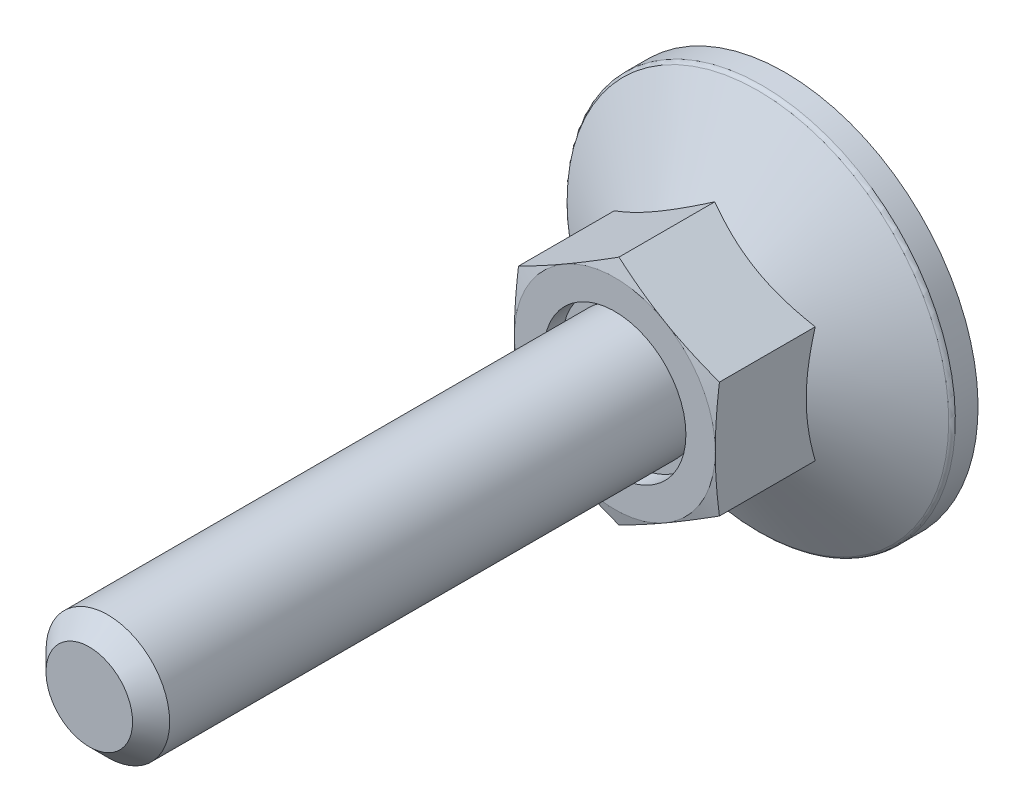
ISO-10303-21;
HEADER;
FILE_DESCRIPTION(('STEP AP214'),'2;1');
FILE_NAME('part.step','',(''),(''),'','','');
FILE_SCHEMA(('AUTOMOTIVE_DESIGN { 1 0 10303 214 1 1 1 1 }'));
ENDSEC;
DATA;
#1=APPLICATION_CONTEXT('core data for automotive mechanical design processes');
#2=APPLICATION_PROTOCOL_DEFINITION('international standard','automotive_design',2000,#1);
#3=PRODUCT_CONTEXT('',#1,'mechanical');
#4=PRODUCT('Part','Part','',(#3));
#5=PRODUCT_RELATED_PRODUCT_CATEGORY('part','',(#4));
#6=PRODUCT_DEFINITION_FORMATION('','',#4);
#7=PRODUCT_DEFINITION_CONTEXT('part definition',#1,'design');
#8=PRODUCT_DEFINITION('design','',#6,#7);
#9=PRODUCT_DEFINITION_SHAPE('','',#8);
#10=(LENGTH_UNIT() NAMED_UNIT(*) SI_UNIT(.MILLI.,.METRE.));
#11=(NAMED_UNIT(*) PLANE_ANGLE_UNIT() SI_UNIT($,.RADIAN.));
#12=(NAMED_UNIT(*) SI_UNIT($,.STERADIAN.) SOLID_ANGLE_UNIT());
#13=UNCERTAINTY_MEASURE_WITH_UNIT(LENGTH_MEASURE(1.E-05),#10,'distance_accuracy_value','');
#14=(GEOMETRIC_REPRESENTATION_CONTEXT(3) GLOBAL_UNCERTAINTY_ASSIGNED_CONTEXT((#13)) GLOBAL_UNIT_ASSIGNED_CONTEXT((#10,
#11,#12)) REPRESENTATION_CONTEXT('',''));
#15=CARTESIAN_POINT('',(0.,0.,0.));
#16=DIRECTION('',(0.,0.,1.));
#17=DIRECTION('',(1.,0.,0.));
#18=AXIS2_PLACEMENT_3D('',#15,#16,#17);
#19=CARTESIAN_POINT('',(0.,0.,9.8));
#20=DIRECTION('',(0.,0.,-1.));
#21=DIRECTION('',(0.,1.,0.));
#22=AXIS2_PLACEMENT_3D('',#19,#20,#21);
#23=PLANE('',#22);
#24=CARTESIAN_POINT('',(0.,0.,9.8));
#25=DIRECTION('',(0.,0.,-1.));
#26=DIRECTION('',(-1.,0.,0.));
#27=AXIS2_PLACEMENT_3D('',#24,#25,#26);
#28=CIRCLE('',#27,4.6);
#29=CARTESIAN_POINT('',(-4.6,0.,9.8));
#30=VERTEX_POINT('',#29);
#31=EDGE_CURVE('E346',#30,#30,#28,.F.);
#32=ORIENTED_EDGE('',*,*,#31,.T.);
#33=EDGE_LOOP('',(#32));
#34=FACE_BOUND('',#33,.T.);
#35=CARTESIAN_POINT('',(0.,0.,9.8));
#36=DIRECTION('',(0.,0.,-1.));
#37=DIRECTION('',(-1.,0.,0.));
#38=AXIS2_PLACEMENT_3D('',#35,#36,#37);
#39=CIRCLE('',#38,4.);
#40=CARTESIAN_POINT('',(-4.,0.,9.8));
#41=VERTEX_POINT('',#40);
#42=EDGE_CURVE('E349',#41,#41,#39,.F.);
#43=ORIENTED_EDGE('',*,*,#42,.F.);
#44=EDGE_LOOP('',(#43));
#45=FACE_BOUND('',#44,.T.);
#46=ADVANCED_FACE('F14',(#34,#45),#23,.F.);
#47=CARTESIAN_POINT('',(7.8,0.,0.));
#48=DIRECTION('',(0.,0.,1.));
#49=DIRECTION('',(0.,-1.,0.));
#50=AXIS2_PLACEMENT_3D('',#47,#48,#49);
#51=PLANE('',#50);
#52=DIRECTION('',(1.,0.,0.));
#53=VECTOR('',#52,1.);
#54=CARTESIAN_POINT('',(1.,-1.,0.));
#55=LINE('',#54,#53);
#56=CARTESIAN_POINT('',(1.,-1.,0.));
#57=VERTEX_POINT('',#56);
#58=CARTESIAN_POINT('',(4.16666666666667,-1.,0.));
#59=VERTEX_POINT('',#58);
#60=EDGE_CURVE('E697',#57,#59,#55,.T.);
#61=ORIENTED_EDGE('',*,*,#60,.T.);
#62=DIRECTION('',(0.,-1.,0.));
#63=VECTOR('',#62,1.);
#64=CARTESIAN_POINT('',(4.16666666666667,0.,0.));
#65=LINE('',#64,#63);
#66=CARTESIAN_POINT('',(4.16666666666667,1.,0.));
#67=VERTEX_POINT('',#66);
#68=EDGE_CURVE('E351',#67,#59,#65,.T.);
#69=ORIENTED_EDGE('',*,*,#68,.F.);
#70=DIRECTION('',(-1.,0.,0.));
#71=VECTOR('',#70,1.);
#72=CARTESIAN_POINT('',(4.16666666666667,1.,0.));
#73=LINE('',#72,#71);
#74=CARTESIAN_POINT('',(1.,1.,0.));
#75=VERTEX_POINT('',#74);
#76=EDGE_CURVE('E700',#67,#75,#73,.T.);
#77=ORIENTED_EDGE('',*,*,#76,.T.);
#78=DIRECTION('',(0.,1.,0.));
#79=VECTOR('',#78,1.);
#80=CARTESIAN_POINT('',(1.,1.,0.));
#81=LINE('',#80,#79);
#82=CARTESIAN_POINT('',(1.,4.16666666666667,0.));
#83=VERTEX_POINT('',#82);
#84=EDGE_CURVE('E703',#75,#83,#81,.T.);
#85=ORIENTED_EDGE('',*,*,#84,.T.);
#86=DIRECTION('',(-1.,0.,0.));
#87=VECTOR('',#86,1.);
#88=CARTESIAN_POINT('',(1.,4.16666666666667,0.));
#89=LINE('',#88,#87);
#90=CARTESIAN_POINT('',(-1.,4.16666666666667,0.));
#91=VERTEX_POINT('',#90);
#92=EDGE_CURVE('E706',#83,#91,#89,.T.);
#93=ORIENTED_EDGE('',*,*,#92,.T.);
#94=DIRECTION('',(0.,-1.,0.));
#95=VECTOR('',#94,1.);
#96=CARTESIAN_POINT('',(-1.,4.16666666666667,0.));
#97=LINE('',#96,#95);
#98=CARTESIAN_POINT('',(-1.,1.,0.));
#99=VERTEX_POINT('',#98);
#100=EDGE_CURVE('E175',#91,#99,#97,.T.);
#101=ORIENTED_EDGE('',*,*,#100,.T.);
#102=DIRECTION('',(-1.,0.,0.));
#103=VECTOR('',#102,1.);
#104=CARTESIAN_POINT('',(-1.,1.,0.));
#105=LINE('',#104,#103);
#106=CARTESIAN_POINT('',(-4.16666666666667,1.,0.));
#107=VERTEX_POINT('',#106);
#108=EDGE_CURVE('E29',#99,#107,#105,.T.);
#109=ORIENTED_EDGE('',*,*,#108,.T.);
#110=DIRECTION('',(0.,-1.,0.));
#111=VECTOR('',#110,1.);
#112=CARTESIAN_POINT('',(-4.16666666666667,1.,0.));
#113=LINE('',#112,#111);
#114=CARTESIAN_POINT('',(-4.16666666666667,-1.,0.));
#115=VERTEX_POINT('',#114);
#116=EDGE_CURVE('E179',#107,#115,#113,.T.);
#117=ORIENTED_EDGE('',*,*,#116,.T.);
#118=DIRECTION('',(1.,0.,0.));
#119=VECTOR('',#118,1.);
#120=CARTESIAN_POINT('',(-4.16666666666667,-1.,0.));
#121=LINE('',#120,#119);
#122=CARTESIAN_POINT('',(-1.,-1.,0.));
#123=VERTEX_POINT('',#122);
#124=EDGE_CURVE('E685',#115,#123,#121,.T.);
#125=ORIENTED_EDGE('',*,*,#124,.T.);
#126=DIRECTION('',(0.,-1.,0.));
#127=VECTOR('',#126,1.);
#128=CARTESIAN_POINT('',(-1.,-1.,0.));
#129=LINE('',#128,#127);
#130=CARTESIAN_POINT('',(-1.,-4.16666666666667,0.));
#131=VERTEX_POINT('',#130);
#132=EDGE_CURVE('E688',#123,#131,#129,.T.);
#133=ORIENTED_EDGE('',*,*,#132,.T.);
#134=DIRECTION('',(1.,0.,0.));
#135=VECTOR('',#134,1.);
#136=CARTESIAN_POINT('',(-1.,-4.16666666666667,0.));
#137=LINE('',#136,#135);
#138=CARTESIAN_POINT('',(1.,-4.16666666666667,0.));
#139=VERTEX_POINT('',#138);
#140=EDGE_CURVE('E691',#131,#139,#137,.T.);
#141=ORIENTED_EDGE('',*,*,#140,.T.);
#142=DIRECTION('',(0.,1.,0.));
#143=VECTOR('',#142,1.);
#144=CARTESIAN_POINT('',(1.,-4.16666666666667,0.));
#145=LINE('',#144,#143);
#146=EDGE_CURVE('E694',#139,#57,#145,.T.);
#147=ORIENTED_EDGE('',*,*,#146,.T.);
#148=EDGE_LOOP('',(#61,#69,#77,#85,#93,#101,#109,#117,#125,#133,#141,#147));
#149=FACE_BOUND('',#148,.T.);
#150=CARTESIAN_POINT('',(0.,0.,0.));
#151=DIRECTION('',(0.,0.,-1.));
#152=DIRECTION('',(0.,1.,0.));
#153=AXIS2_PLACEMENT_3D('',#150,#151,#152);
#154=CIRCLE('',#153,12.5);
#155=CARTESIAN_POINT('',(0.,12.5,0.));
#156=VERTEX_POINT('',#155);
#157=EDGE_CURVE('E180',#156,#156,#154,.T.);
#158=ORIENTED_EDGE('',*,*,#157,.T.);
#159=EDGE_LOOP('',(#158));
#160=FACE_BOUND('',#159,.T.);
#161=ADVANCED_FACE('F294',(#149,#160),#51,.F.);
#162=CARTESIAN_POINT('',(0.,7.50555349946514,48.));
#163=DIRECTION('',(0.5,-0.866025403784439,0.));
#164=DIRECTION('',(0.866025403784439,0.5,0.));
#165=AXIS2_PLACEMENT_3D('',#162,#163,#164);
#166=PLANE('',#165);
#167=CARTESIAN_POINT('',(-6.5002,3.75266127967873,4.53347836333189));
#168=CARTESIAN_POINT('',(-6.35732254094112,3.83515161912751,4.58109719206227));
#169=CARTESIAN_POINT('',(-6.21391236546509,3.91794952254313,4.62655491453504));
#170=CARTESIAN_POINT('',(-5.92592736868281,4.08421773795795,4.7125529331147));
#171=CARTESIAN_POINT('',(-5.78135207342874,4.16768832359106,4.75309110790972));
#172=CARTESIAN_POINT('',(-5.34531134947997,4.41943655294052,4.86653061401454));
#173=CARTESIAN_POINT('',(-5.05212471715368,4.5887079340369,4.93105380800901));
#174=CARTESIAN_POINT('',(-4.61337625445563,4.84201947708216,5.00671503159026));
#175=CARTESIAN_POINT('',(-4.46912536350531,4.92530276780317,5.02826875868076));
#176=CARTESIAN_POINT('',(-4.17997178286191,5.09224566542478,5.06441130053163));
#177=CARTESIAN_POINT('',(-4.03506915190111,5.17590523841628,5.07900073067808));
#178=CARTESIAN_POINT('',(-3.74501222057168,5.34336968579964,5.1008428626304));
#179=CARTESIAN_POINT('',(-3.59985839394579,5.42717428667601,5.10810389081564));
#180=CARTESIAN_POINT('',(-3.30942466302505,5.59485627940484,5.11514131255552));
#181=CARTESIAN_POINT('',(-3.16414476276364,5.6787336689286,5.11491793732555));
#182=CARTESIAN_POINT('',(-2.7661240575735,5.90853103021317,5.10401815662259));
#183=CARTESIAN_POINT('',(-2.51351353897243,6.05437578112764,5.08571979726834));
#184=CARTESIAN_POINT('',(-2.00997032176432,6.34509659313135,5.02769527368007));
#185=CARTESIAN_POINT('',(-1.75903939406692,6.48997163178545,4.98794927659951));
#186=CARTESIAN_POINT('',(-1.25448277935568,6.78127752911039,4.8885957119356));
#187=CARTESIAN_POINT('',(-1.00092075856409,6.92767163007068,4.82856718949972));
#188=CARTESIAN_POINT('',(-0.497578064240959,7.21827667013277,4.69232662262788));
#189=CARTESIAN_POINT('',(-0.247790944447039,7.36249133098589,4.61614658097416));
#190=CARTESIAN_POINT('',(0.000199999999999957,7.50566896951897,4.53347836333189));
#191=B_SPLINE_CURVE_WITH_KNOTS('',3,(#167,#168,#169,#170,#171,#172,#173,#174,#175,#176,#177,
#178,#179,#180,#181,#182,#183,#184,#185,#186,#187,#188,#189,#190),.UNSPECIFIED.,.F.,.F.,(4,2,2,
2,2,2,2,2,2,2,2,4),(0.,0.515105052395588,1.03043143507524,2.06322554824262,2.56697389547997,
3.07067772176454,3.57380860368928,4.0769239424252,4.9527935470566,5.82947446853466,
6.72559912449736,7.61996451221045),.UNSPECIFIED.);
#192=CARTESIAN_POINT('',(-6.5,3.75277674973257,4.53354503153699));
#193=VERTEX_POINT('',#192);
#194=CARTESIAN_POINT('',(0.,7.50555349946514,4.53354503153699));
#195=VERTEX_POINT('',#194);
#196=EDGE_CURVE('E251',#193,#195,#191,.T.);
#197=ORIENTED_EDGE('',*,*,#196,.F.);
#198=DIRECTION('',(0.,0.,-1.));
#199=VECTOR('',#198,1.);
#200=CARTESIAN_POINT('',(-6.5,3.75277674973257,48.));
#201=LINE('',#200,#199);
#202=CARTESIAN_POINT('',(-6.5,3.75277674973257,10.730562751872));
#203=VERTEX_POINT('',#202);
#204=EDGE_CURVE('E408',#203,#193,#201,.T.);
#205=ORIENTED_EDGE('',*,*,#204,.F.);
#206=CARTESIAN_POINT('',(0.0002,7.50566896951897,10.7305318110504));
#207=CARTESIAN_POINT('',(-0.26974524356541,7.34981601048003,10.772310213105));
#208=CARTESIAN_POINT('',(-0.540179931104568,7.19368047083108,10.8102381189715));
#209=CARTESIAN_POINT('',(-1.08200437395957,6.88085798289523,10.8768739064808));
#210=CARTESIAN_POINT('',(-1.35339447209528,6.72417083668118,10.9055780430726));
#211=CARTESIAN_POINT('',(-1.8954842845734,6.41119513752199,10.9520905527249));
#212=CARTESIAN_POINT('',(-2.16618033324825,6.25490870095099,10.9699543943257));
#213=CARTESIAN_POINT('',(-2.70791763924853,5.94213652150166,10.9939079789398));
#214=CARTESIAN_POINT('',(-2.97895881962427,5.78565082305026,11.));
#215=CARTESIAN_POINT('',(-3.52104118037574,5.47267942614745,11.));
#216=CARTESIAN_POINT('',(-3.79208236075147,5.31619372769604,10.9939079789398));
#217=CARTESIAN_POINT('',(-4.33381966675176,5.00342154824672,10.9699543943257));
#218=CARTESIAN_POINT('',(-4.60451571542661,4.84713511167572,10.9520905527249));
#219=CARTESIAN_POINT('',(-5.14660552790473,4.53415941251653,10.9055780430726));
#220=CARTESIAN_POINT('',(-5.41799562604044,4.37747226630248,10.8768739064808));
#221=CARTESIAN_POINT('',(-5.95982006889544,4.06464977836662,10.8102381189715));
#222=CARTESIAN_POINT('',(-6.23025475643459,3.90851423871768,10.772310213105));
#223=CARTESIAN_POINT('',(-6.5002,3.75266127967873,10.7305318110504));
#224=B_SPLINE_CURVE_WITH_KNOTS('',3,(#206,#207,#208,#209,#210,#211,#212,#213,#214,#215,#216,
#217,#218,#219,#220,#221,#222,#223),.UNSPECIFIED.,.F.,.F.,(4,2,2,2,2,2,2,2,4),(0.,
0.943529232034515,1.88744107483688,2.82648138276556,3.76533995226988,4.70419852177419,
5.64323882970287,6.58715067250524,7.53067990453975),.UNSPECIFIED.);
#225=CARTESIAN_POINT('',(-3.25,5.62916512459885,11.));
#226=VERTEX_POINT('',#225);
#227=EDGE_CURVE('E281',#226,#203,#224,.T.);
#228=ORIENTED_EDGE('',*,*,#227,.F.);
#229=CARTESIAN_POINT('',(0.,7.50555349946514,10.730562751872));
#230=VERTEX_POINT('',#229);
#231=EDGE_CURVE('E372',#230,#226,#224,.T.);
#232=ORIENTED_EDGE('',*,*,#231,.F.);
#233=DIRECTION('',(0.,0.,-1.));
#234=VECTOR('',#233,1.);
#235=CARTESIAN_POINT('',(0.,7.50555349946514,48.));
#236=LINE('',#235,#234);
#237=EDGE_CURVE('E392',#230,#195,#236,.T.);
#238=ORIENTED_EDGE('',*,*,#237,.T.);
#239=EDGE_LOOP('',(#197,#205,#228,#232,#238));
#240=FACE_BOUND('',#239,.T.);
#241=ADVANCED_FACE('F223',(#240),#166,.F.);
#242=CARTESIAN_POINT('',(6.5,3.75277674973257,48.));
#243=DIRECTION('',(-0.5,-0.866025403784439,0.));
#244=DIRECTION('',(0.866025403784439,-0.5,0.));
#245=AXIS2_PLACEMENT_3D('',#242,#243,#244);
#246=PLANE('',#245);
#247=CARTESIAN_POINT('',(-0.0002,7.50566896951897,4.53347836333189));
#248=CARTESIAN_POINT('',(0.142677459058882,7.4231786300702,4.58109719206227));
#249=CARTESIAN_POINT('',(0.286087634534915,7.34038072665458,4.62655491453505));
#250=CARTESIAN_POINT('',(0.574072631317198,7.17411251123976,4.71255293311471));
#251=CARTESIAN_POINT('',(0.718647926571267,7.09064192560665,4.75309110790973));
#252=CARTESIAN_POINT('',(1.15468865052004,6.83889369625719,4.86653061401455));
#253=CARTESIAN_POINT('',(1.44787528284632,6.66962231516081,4.93105380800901));
#254=CARTESIAN_POINT('',(1.88662374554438,6.41631077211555,5.00671503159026));
#255=CARTESIAN_POINT('',(2.03087463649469,6.33302748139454,5.02826875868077));
#256=CARTESIAN_POINT('',(2.32002821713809,6.16608458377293,5.06441130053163));
#257=CARTESIAN_POINT('',(2.46493084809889,6.08242501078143,5.07900073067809));
#258=CARTESIAN_POINT('',(2.75498777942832,5.91496056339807,5.10084286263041));
#259=CARTESIAN_POINT('',(2.90014160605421,5.8311559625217,5.10810389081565));
#260=CARTESIAN_POINT('',(3.19057533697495,5.66347396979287,5.11514131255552));
#261=CARTESIAN_POINT('',(3.33585523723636,5.5795965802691,5.11491793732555));
#262=CARTESIAN_POINT('',(3.73387594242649,5.34979921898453,5.10401815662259));
#263=CARTESIAN_POINT('',(3.98648646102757,5.20395446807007,5.08571979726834));
#264=CARTESIAN_POINT('',(4.49002967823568,4.91323365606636,5.02769527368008));
#265=CARTESIAN_POINT('',(4.74096060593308,4.76835861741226,4.98794927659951));
#266=CARTESIAN_POINT('',(5.24551722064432,4.47705272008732,4.8885957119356));
#267=CARTESIAN_POINT('',(5.49907924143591,4.33065861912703,4.82856718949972));
#268=CARTESIAN_POINT('',(6.00242193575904,4.04005357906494,4.69232662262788));
#269=CARTESIAN_POINT('',(6.25220905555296,3.89583891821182,4.61614658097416));
#270=CARTESIAN_POINT('',(6.5002,3.75266127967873,4.53347836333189));
#271=B_SPLINE_CURVE_WITH_KNOTS('',3,(#247,#248,#249,#250,#251,#252,#253,#254,#255,#256,#257,
#258,#259,#260,#261,#262,#263,#264,#265,#266,#267,#268,#269,#270),.UNSPECIFIED.,.F.,.F.,(4,2,2,
2,2,2,2,2,2,2,2,4),(0.,0.515105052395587,1.03043143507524,2.06322554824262,2.56697389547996,
3.07067772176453,3.57380860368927,4.0769239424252,4.9527935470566,5.82947446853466,
6.72559912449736,7.61996451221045),.UNSPECIFIED.);
#272=CARTESIAN_POINT('',(6.5,3.75277674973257,4.53354503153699));
#273=VERTEX_POINT('',#272);
#274=EDGE_CURVE('E37',#195,#273,#271,.T.);
#275=ORIENTED_EDGE('',*,*,#274,.F.);
#276=ORIENTED_EDGE('',*,*,#237,.F.);
#277=CARTESIAN_POINT('',(6.5002,3.75266127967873,10.7305318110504));
#278=CARTESIAN_POINT('',(6.23025475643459,3.90851423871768,10.772310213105));
#279=CARTESIAN_POINT('',(5.95982006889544,4.06464977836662,10.8102381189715));
#280=CARTESIAN_POINT('',(5.41799562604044,4.37747226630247,10.8768739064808));
#281=CARTESIAN_POINT('',(5.14660552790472,4.53415941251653,10.9055780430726));
#282=CARTESIAN_POINT('',(4.60451571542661,4.84713511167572,10.9520905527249));
#283=CARTESIAN_POINT('',(4.33381966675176,5.00342154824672,10.9699543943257));
#284=CARTESIAN_POINT('',(3.79208236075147,5.31619372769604,10.9939079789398));
#285=CARTESIAN_POINT('',(3.52104118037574,5.47267942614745,11.));
#286=CARTESIAN_POINT('',(2.97895881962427,5.78565082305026,11.));
#287=CARTESIAN_POINT('',(2.70791763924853,5.94213652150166,10.9939079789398));
#288=CARTESIAN_POINT('',(2.16618033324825,6.25490870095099,10.9699543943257));
#289=CARTESIAN_POINT('',(1.89548428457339,6.41119513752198,10.9520905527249));
#290=CARTESIAN_POINT('',(1.35339447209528,6.72417083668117,10.9055780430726));
#291=CARTESIAN_POINT('',(1.08200437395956,6.88085798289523,10.8768739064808));
#292=CARTESIAN_POINT('',(0.540179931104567,7.19368047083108,10.8102381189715));
#293=CARTESIAN_POINT('',(0.26974524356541,7.34981601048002,10.772310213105));
#294=CARTESIAN_POINT('',(-0.000199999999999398,7.50566896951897,10.7305318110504));
#295=B_SPLINE_CURVE_WITH_KNOTS('',3,(#277,#278,#279,#280,#281,#282,#283,#284,#285,#286,#287,
#288,#289,#290,#291,#292,#293,#294),.UNSPECIFIED.,.F.,.F.,(4,2,2,2,2,2,2,2,4),(0.,
0.943529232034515,1.88744107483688,2.82648138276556,3.76533995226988,4.70419852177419,
5.64323882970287,6.58715067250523,7.53067990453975),.UNSPECIFIED.);
#296=CARTESIAN_POINT('',(3.25,5.62916512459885,11.));
#297=VERTEX_POINT('',#296);
#298=EDGE_CURVE('E264',#297,#230,#295,.T.);
#299=ORIENTED_EDGE('',*,*,#298,.F.);
#300=CARTESIAN_POINT('',(6.5,3.75277674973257,10.730562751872));
#301=VERTEX_POINT('',#300);
#302=EDGE_CURVE('E273',#301,#297,#295,.T.);
#303=ORIENTED_EDGE('',*,*,#302,.F.);
#304=DIRECTION('',(0.,0.,-1.));
#305=VECTOR('',#304,1.);
#306=CARTESIAN_POINT('',(6.5,3.75277674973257,48.));
#307=LINE('',#306,#305);
#308=EDGE_CURVE('E395',#301,#273,#307,.T.);
#309=ORIENTED_EDGE('',*,*,#308,.T.);
#310=EDGE_LOOP('',(#275,#276,#299,#303,#309));
#311=FACE_BOUND('',#310,.T.);
#312=ADVANCED_FACE('F257',(#311),#246,.F.);
#313=CARTESIAN_POINT('',(6.5,-3.75277674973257,48.));
#314=DIRECTION('',(-1.,0.,0.));
#315=DIRECTION('',(0.,-1.,0.));
#316=AXIS2_PLACEMENT_3D('',#313,#314,#315);
#317=PLANE('',#316);
#318=CARTESIAN_POINT('',(6.5,10.067414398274,1.94823609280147));
#319=CARTESIAN_POINT('',(6.5,9.78352438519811,2.08589580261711));
#320=CARTESIAN_POINT('',(6.5,9.49898106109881,2.22223138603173));
#321=CARTESIAN_POINT('',(6.5,8.92824011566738,2.49150895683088));
#322=CARTESIAN_POINT('',(6.5,8.64204224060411,2.62445040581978));
#323=CARTESIAN_POINT('',(6.5,8.06616487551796,2.88686541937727));
#324=CARTESIAN_POINT('',(6.5,7.77647490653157,3.01631606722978));
#325=CARTESIAN_POINT('',(6.5,7.19478507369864,3.26989907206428));
#326=CARTESIAN_POINT('',(6.5,6.90278532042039,3.39403168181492));
#327=CARTESIAN_POINT('',(6.5,6.30684739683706,3.63934571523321));
#328=CARTESIAN_POINT('',(6.5,6.00282105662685,3.76031411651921));
#329=CARTESIAN_POINT('',(6.5,5.39120706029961,3.99306391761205));
#330=CARTESIAN_POINT('',(6.5,5.08361900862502,4.10484428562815));
#331=CARTESIAN_POINT('',(6.5,4.46497231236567,4.31627594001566));
#332=CARTESIAN_POINT('',(6.5,4.15392216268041,4.41595183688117));
#333=CARTESIAN_POINT('',(6.5,3.52735818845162,4.59996747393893));
#334=CARTESIAN_POINT('',(6.5,3.21184580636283,4.68431205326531));
#335=CARTESIAN_POINT('',(6.5,2.57783458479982,4.83319256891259));
#336=CARTESIAN_POINT('',(6.5,2.25935972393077,4.89782898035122));
#337=CARTESIAN_POINT('',(6.5,1.61842059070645,5.00357646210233));
#338=CARTESIAN_POINT('',(6.5,1.29595672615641,5.04468991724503));
#339=CARTESIAN_POINT('',(6.5,0.812693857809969,5.08598811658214));
#340=CARTESIAN_POINT('',(6.5,0.652724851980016,5.09635596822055));
#341=CARTESIAN_POINT('',(6.5,0.332484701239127,5.11032435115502));
#342=CARTESIAN_POINT('',(6.5,0.172213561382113,5.11392499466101));
#343=CARTESIAN_POINT('',(6.5,-0.148338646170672,5.11426557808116));
#344=CARTESIAN_POINT('',(6.5,-0.30861971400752,5.11100536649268));
#345=CARTESIAN_POINT('',(6.5,-0.628902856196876,5.09770543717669));
#346=CARTESIAN_POINT('',(6.5,-0.788904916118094,5.08766537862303));
#347=CARTESIAN_POINT('',(6.5,-1.17366735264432,5.05558094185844));
#348=CARTESIAN_POINT('',(6.5,-1.39816400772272,5.03030719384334));
#349=CARTESIAN_POINT('',(6.5,-1.84547349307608,4.96779217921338));
#350=CARTESIAN_POINT('',(6.5,-2.06828609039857,4.93054928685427));
#351=CARTESIAN_POINT('',(6.5,-2.73393776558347,4.80284369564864));
#352=CARTESIAN_POINT('',(6.5,-3.17375537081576,4.6964262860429));
#353=CARTESIAN_POINT('',(6.5,-3.83171733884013,4.51203063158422));
#354=CARTESIAN_POINT('',(6.5,-4.05327258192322,4.44552609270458));
#355=CARTESIAN_POINT('',(6.5,-4.49422901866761,4.30565892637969));
#356=CARTESIAN_POINT('',(6.5,-4.71363019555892,4.23229624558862));
#357=CARTESIAN_POINT('',(6.5,-5.15035386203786,4.07988627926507));
#358=CARTESIAN_POINT('',(6.5,-5.3676769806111,4.00084077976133));
#359=CARTESIAN_POINT('',(6.5,-5.80052072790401,3.83799065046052));
#360=CARTESIAN_POINT('',(6.5,-6.01604140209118,3.75418614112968));
#361=CARTESIAN_POINT('',(6.5,-6.61842771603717,3.51353035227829));
#362=CARTESIAN_POINT('',(6.5,-7.00350435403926,3.35220459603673));
#363=CARTESIAN_POINT('',(6.5,-7.76959629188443,3.02014813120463));
#364=CARTESIAN_POINT('',(6.5,-8.15061109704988,2.84941629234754));
#365=CARTESIAN_POINT('',(6.5,-8.90957192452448,2.50088582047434));
#366=CARTESIAN_POINT('',(6.5,-9.28751663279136,2.3230843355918));
#367=CARTESIAN_POINT('',(6.5,-10.0408394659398,1.96218611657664));
#368=CARTESIAN_POINT('',(6.5,-10.4162177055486,1.77908962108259));
#369=CARTESIAN_POINT('',(6.5,-11.1655631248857,1.40849620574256));
#370=CARTESIAN_POINT('',(6.5,-11.5395269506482,1.22099251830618));
#371=CARTESIAN_POINT('',(6.5,-12.2858210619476,0.842758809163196));
#372=CARTESIAN_POINT('',(6.5,-12.6581513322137,0.652028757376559));
#373=CARTESIAN_POINT('',(6.5,-13.4013949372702,0.268043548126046));
#374=CARTESIAN_POINT('',(6.5,-13.7723085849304,0.0747889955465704));
#375=CARTESIAN_POINT('',(6.5,-14.5130449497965,-0.313800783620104));
#376=CARTESIAN_POINT('',(6.5,-14.8828676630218,-0.509136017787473));
#377=CARTESIAN_POINT('',(6.5,-15.9085714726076,-1.05391022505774));
#378=CARTESIAN_POINT('',(6.5,-16.5634819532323,-1.40517623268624));
#379=CARTESIAN_POINT('',(6.5,-17.8712672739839,-2.11157255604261));
#380=CARTESIAN_POINT('',(6.5,-18.5241419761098,-2.4667031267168));
#381=CARTESIAN_POINT('',(6.5,-19.8261496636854,-3.17862531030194));
#382=CARTESIAN_POINT('',(6.5,-20.475287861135,-3.53540739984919));
#383=CARTESIAN_POINT('',(6.5,-21.7722968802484,-4.25114422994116));
#384=CARTESIAN_POINT('',(6.5,-22.4201678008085,-4.61009879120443));
#385=CARTESIAN_POINT('',(6.5,-23.0675997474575,-4.9698379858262));
#386=B_SPLINE_CURVE_WITH_KNOTS('',3,(#318,#319,#320,#321,#322,#323,#324,#325,#326,#327,#328,
#329,#330,#331,#332,#333,#334,#335,#336,#337,#338,#339,#340,#341,#342,#343,#344,#345,#346,#347,
#348,#349,#350,#351,#352,#353,#354,#355,#356,#357,#358,#359,#360,#361,#362,#363,#364,#365,#366,
#367,#368,#369,#370,#371,#372,#373,#374,#375,#376,#377,#378,#379,#380,#381,#382,#383,#384,#385),
.UNSPECIFIED.,.F.,.F.,(4,2,2,2,2,2,2,2,2,2,2,2,2,2,2,2,2,2,2,2,2,2,2,2,2,2,2,2,2,2,2,2,2,4),(0.,
0.946528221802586,1.89320566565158,2.84505559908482,3.79686024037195,4.77837094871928,
5.75999172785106,6.73958204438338,7.71886262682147,8.69306383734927,9.66716626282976,
10.1479587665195,10.6287432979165,11.1095384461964,11.5903577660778,12.267719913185,
12.9451741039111,14.3007885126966,14.9946950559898,15.6886069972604,16.3823017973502,
17.0759790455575,18.3282990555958,19.5807698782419,20.8337511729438,22.086676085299,
23.3416700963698,24.5966758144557,25.8513861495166,27.1061010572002,29.335578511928,
31.5652039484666,33.7873748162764,36.0093647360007),.UNSPECIFIED.);
#387=CARTESIAN_POINT('',(6.5,-3.75277674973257,4.53354503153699));
#388=VERTEX_POINT('',#387);
#389=EDGE_CURVE('E240',#273,#388,#386,.T.);
#390=ORIENTED_EDGE('',*,*,#389,.F.);
#391=ORIENTED_EDGE('',*,*,#308,.F.);
#392=CARTESIAN_POINT('',(6.5,9.92747995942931,9.56215186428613));
#393=CARTESIAN_POINT('',(6.5,9.63259364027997,9.62823955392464));
#394=CARTESIAN_POINT('',(6.5,9.33752287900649,9.69351898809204));
#395=CARTESIAN_POINT('',(6.5,8.7469218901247,9.82202506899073));
#396=CARTESIAN_POINT('',(6.5,8.45139164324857,9.88525162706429));
#397=CARTESIAN_POINT('',(6.5,7.85951636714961,10.0092707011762));
#398=CARTESIAN_POINT('',(6.5,7.56317082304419,10.0700607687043));
#399=CARTESIAN_POINT('',(6.5,6.96986292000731,10.1885506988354));
#400=CARTESIAN_POINT('',(6.5,6.67290056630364,10.2462505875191));
#401=CARTESIAN_POINT('',(6.5,6.08062010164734,10.3573796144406));
#402=CARTESIAN_POINT('',(6.5,5.78530770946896,10.4108390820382));
#403=CARTESIAN_POINT('',(6.5,5.19387740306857,10.513090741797));
#404=CARTESIAN_POINT('',(6.5,4.89775950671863,10.5618830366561));
#405=CARTESIAN_POINT('',(6.5,4.30466070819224,10.6537017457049));
#406=CARTESIAN_POINT('',(6.5,4.00767991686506,10.6967288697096));
#407=CARTESIAN_POINT('',(6.5,3.4127732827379,10.7757492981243));
#408=CARTESIAN_POINT('',(6.5,3.1148474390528,10.8117425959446));
#409=CARTESIAN_POINT('',(6.5,2.51468954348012,10.8756761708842));
#410=CARTESIAN_POINT('',(6.5,2.21244707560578,10.9035201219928));
#411=CARTESIAN_POINT('',(6.5,1.60720229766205,10.9492341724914));
#412=CARTESIAN_POINT('',(6.5,1.30420000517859,10.9671045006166));
#413=CARTESIAN_POINT('',(6.5,0.697875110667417,10.9918290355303));
#414=CARTESIAN_POINT('',(6.5,0.394552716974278,10.9986882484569));
#415=CARTESIAN_POINT('',(6.5,-0.212135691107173,11.0009688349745));
#416=CARTESIAN_POINT('',(6.5,-0.515501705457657,10.9963902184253));
#417=CARTESIAN_POINT('',(6.5,-1.12295501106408,10.9760526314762));
#418=CARTESIAN_POINT('',(6.5,-1.42704091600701,10.9602530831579));
#419=CARTESIAN_POINT('',(6.5,-2.03449758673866,10.9183754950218));
#420=CARTESIAN_POINT('',(6.5,-2.33786833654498,10.8922972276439));
#421=CARTESIAN_POINT('',(6.5,-2.94389214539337,10.8311794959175));
#422=CARTESIAN_POINT('',(6.5,-3.24654460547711,10.7961341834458));
#423=CARTESIAN_POINT('',(6.5,-3.85087551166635,10.7185406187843));
#424=CARTESIAN_POINT('',(6.5,-4.15255395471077,10.6759923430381));
#425=CARTESIAN_POINT('',(6.5,-4.73502363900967,10.5877746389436));
#426=CARTESIAN_POINT('',(6.5,-5.01587505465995,10.5424985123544));
#427=CARTESIAN_POINT('',(6.5,-5.57683763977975,10.4475514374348));
#428=CARTESIAN_POINT('',(6.5,-5.85694878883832,10.3978803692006));
#429=CARTESIAN_POINT('',(6.5,-6.41653333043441,10.2949474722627));
#430=CARTESIAN_POINT('',(6.5,-6.69600666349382,10.241685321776));
#431=CARTESIAN_POINT('',(6.5,-7.2543793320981,10.1322258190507));
#432=CARTESIAN_POINT('',(6.5,-7.53327866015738,10.0760284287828));
#433=CARTESIAN_POINT('',(6.5,-8.36936246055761,9.90383082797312));
#434=CARTESIAN_POINT('',(6.5,-8.92580841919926,9.78424858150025));
#435=CARTESIAN_POINT('',(6.5,-10.037220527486,9.53861051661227));
#436=CARTESIAN_POINT('',(6.5,-10.5921867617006,9.41255507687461));
#437=CARTESIAN_POINT('',(6.5,-11.6956125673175,9.15714489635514));
#438=CARTESIAN_POINT('',(6.5,-12.2440824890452,9.02783474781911));
#439=CARTESIAN_POINT('',(6.5,-13.3402571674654,8.76597711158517));
#440=CARTESIAN_POINT('',(6.5,-13.8879619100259,8.63342956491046));
#441=CARTESIAN_POINT('',(6.5,-14.9821103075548,8.36610757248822));
#442=CARTESIAN_POINT('',(6.5,-15.5285546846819,8.23133607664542));
#443=CARTESIAN_POINT('',(6.5,-16.620967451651,7.95995280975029));
#444=CARTESIAN_POINT('',(6.5,-17.166935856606,7.82334109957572));
#445=CARTESIAN_POINT('',(6.5,-17.7127383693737,7.6860776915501));
#446=B_SPLINE_CURVE_WITH_KNOTS('',3,(#392,#393,#394,#395,#396,#397,#398,#399,#400,#401,#402,
#403,#404,#405,#406,#407,#408,#409,#410,#411,#412,#413,#414,#415,#416,#417,#418,#419,#420,#421,
#422,#423,#424,#425,#426,#427,#428,#429,#430,#431,#432,#433,#434,#435,#436,#437,#438,#439,#440,
#441,#442,#443,#444,#445),.UNSPECIFIED.,.F.,.F.,(4,2,2,2,2,2,2,2,2,2,2,2,2,2,2,2,2,2,2,2,2,2,2,
2,2,2,4),(0.,0.906607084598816,1.8132532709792,2.72078883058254,3.62831672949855,
4.52862337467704,5.42891020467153,6.32908608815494,7.22926281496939,8.13968571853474,
9.05008774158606,9.96007573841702,10.8700629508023,11.7833577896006,12.6966728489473,
13.6105850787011,14.5245001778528,15.3778915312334,16.2313061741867,17.084797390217,
17.9382996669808,19.6456836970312,21.3529679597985,23.0434756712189,24.7340142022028,
26.4224665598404,28.1108631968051),.UNSPECIFIED.);
#447=CARTESIAN_POINT('',(6.5,0.,11.));
#448=VERTEX_POINT('',#447);
#449=EDGE_CURVE('E275',#448,#301,#446,.F.);
#450=ORIENTED_EDGE('',*,*,#449,.F.);
#451=CARTESIAN_POINT('',(6.5,-3.75277674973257,10.730562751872));
#452=VERTEX_POINT('',#451);
#453=EDGE_CURVE('E274',#452,#448,#446,.F.);
#454=ORIENTED_EDGE('',*,*,#453,.F.);
#455=DIRECTION('',(0.,0.,-1.));
#456=VECTOR('',#455,1.);
#457=CARTESIAN_POINT('',(6.5,-3.75277674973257,48.));
#458=LINE('',#457,#456);
#459=EDGE_CURVE('E398',#452,#388,#458,.T.);
#460=ORIENTED_EDGE('',*,*,#459,.T.);
#461=EDGE_LOOP('',(#390,#391,#450,#454,#460));
#462=FACE_BOUND('',#461,.T.);
#463=ADVANCED_FACE('F260',(#462),#317,.F.);
#464=CARTESIAN_POINT('',(0.,-7.50555349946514,48.));
#465=DIRECTION('',(-0.5,0.866025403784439,0.));
#466=DIRECTION('',(-0.866025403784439,-0.5,0.));
#467=AXIS2_PLACEMENT_3D('',#464,#465,#466);
#468=PLANE('',#467);
#469=CARTESIAN_POINT('',(6.5002,-3.75266127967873,4.53347836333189));
#470=CARTESIAN_POINT('',(6.35732254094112,-3.83515161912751,4.58109719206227));
#471=CARTESIAN_POINT('',(6.21391236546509,-3.91794952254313,4.62655491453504));
#472=CARTESIAN_POINT('',(5.92592736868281,-4.08421773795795,4.7125529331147));
#473=CARTESIAN_POINT('',(5.78135207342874,-4.16768832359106,4.75309110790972));
#474=CARTESIAN_POINT('',(5.34531134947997,-4.41943655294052,4.86653061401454));
#475=CARTESIAN_POINT('',(5.05212471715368,-4.5887079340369,4.93105380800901));
#476=CARTESIAN_POINT('',(4.61337625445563,-4.84201947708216,5.00671503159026));
#477=CARTESIAN_POINT('',(4.46912536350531,-4.92530276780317,5.02826875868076));
#478=CARTESIAN_POINT('',(4.17997178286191,-5.09224566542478,5.06441130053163));
#479=CARTESIAN_POINT('',(4.03506915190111,-5.17590523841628,5.07900073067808));
#480=CARTESIAN_POINT('',(3.74501222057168,-5.34336968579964,5.1008428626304));
#481=CARTESIAN_POINT('',(3.59985839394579,-5.42717428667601,5.10810389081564));
#482=CARTESIAN_POINT('',(3.30942466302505,-5.59485627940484,5.11514131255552));
#483=CARTESIAN_POINT('',(3.16414476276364,-5.6787336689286,5.11491793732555));
#484=CARTESIAN_POINT('',(2.7661240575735,-5.90853103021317,5.10401815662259));
#485=CARTESIAN_POINT('',(2.51351353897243,-6.05437578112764,5.08571979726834));
#486=CARTESIAN_POINT('',(2.00997032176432,-6.34509659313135,5.02769527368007));
#487=CARTESIAN_POINT('',(1.75903939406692,-6.48997163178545,4.98794927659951));
#488=CARTESIAN_POINT('',(1.25448277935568,-6.78127752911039,4.8885957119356));
#489=CARTESIAN_POINT('',(1.00092075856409,-6.92767163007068,4.82856718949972));
#490=CARTESIAN_POINT('',(0.497578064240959,-7.21827667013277,4.69232662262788));
#491=CARTESIAN_POINT('',(0.247790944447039,-7.36249133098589,4.61614658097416));
#492=CARTESIAN_POINT('',(-0.000199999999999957,-7.50566896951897,4.53347836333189));
#493=B_SPLINE_CURVE_WITH_KNOTS('',3,(#469,#470,#471,#472,#473,#474,#475,#476,#477,#478,#479,
#480,#481,#482,#483,#484,#485,#486,#487,#488,#489,#490,#491,#492),.UNSPECIFIED.,.F.,.F.,(4,2,2,
2,2,2,2,2,2,2,2,4),(0.,0.515105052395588,1.03043143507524,2.06322554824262,2.56697389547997,
3.07067772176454,3.57380860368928,4.0769239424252,4.9527935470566,5.82947446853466,
6.72559912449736,7.61996451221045),.UNSPECIFIED.);
#494=CARTESIAN_POINT('',(0.,-7.50555349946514,4.53354503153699));
#495=VERTEX_POINT('',#494);
#496=EDGE_CURVE('E204',#388,#495,#493,.T.);
#497=ORIENTED_EDGE('',*,*,#496,.F.);
#498=ORIENTED_EDGE('',*,*,#459,.F.);
#499=CARTESIAN_POINT('',(-0.0002,-7.50566896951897,10.7305318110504));
#500=CARTESIAN_POINT('',(0.26974524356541,-7.34981601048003,10.772310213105));
#501=CARTESIAN_POINT('',(0.540179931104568,-7.19368047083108,10.8102381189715));
#502=CARTESIAN_POINT('',(1.08200437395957,-6.88085798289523,10.8768739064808));
#503=CARTESIAN_POINT('',(1.35339447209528,-6.72417083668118,10.9055780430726));
#504=CARTESIAN_POINT('',(1.8954842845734,-6.41119513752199,10.9520905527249));
#505=CARTESIAN_POINT('',(2.16618033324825,-6.25490870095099,10.9699543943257));
#506=CARTESIAN_POINT('',(2.70791763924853,-5.94213652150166,10.9939079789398));
#507=CARTESIAN_POINT('',(2.97895881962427,-5.78565082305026,11.));
#508=CARTESIAN_POINT('',(3.52104118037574,-5.47267942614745,11.));
#509=CARTESIAN_POINT('',(3.79208236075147,-5.31619372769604,10.9939079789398));
#510=CARTESIAN_POINT('',(4.33381966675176,-5.00342154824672,10.9699543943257));
#511=CARTESIAN_POINT('',(4.60451571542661,-4.84713511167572,10.9520905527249));
#512=CARTESIAN_POINT('',(5.14660552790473,-4.53415941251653,10.9055780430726));
#513=CARTESIAN_POINT('',(5.41799562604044,-4.37747226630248,10.8768739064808));
#514=CARTESIAN_POINT('',(5.95982006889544,-4.06464977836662,10.8102381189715));
#515=CARTESIAN_POINT('',(6.23025475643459,-3.90851423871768,10.772310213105));
#516=CARTESIAN_POINT('',(6.5002,-3.75266127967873,10.7305318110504));
#517=B_SPLINE_CURVE_WITH_KNOTS('',3,(#499,#500,#501,#502,#503,#504,#505,#506,#507,#508,#509,
#510,#511,#512,#513,#514,#515,#516),.UNSPECIFIED.,.F.,.F.,(4,2,2,2,2,2,2,2,4),(0.,
0.943529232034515,1.88744107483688,2.82648138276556,3.76533995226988,4.70419852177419,
5.64323882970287,6.58715067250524,7.53067990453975),.UNSPECIFIED.);
#518=CARTESIAN_POINT('',(3.25,-5.62916512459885,11.));
#519=VERTEX_POINT('',#518);
#520=EDGE_CURVE('E313',#519,#452,#517,.T.);
#521=ORIENTED_EDGE('',*,*,#520,.F.);
#522=CARTESIAN_POINT('',(0.,-7.50555349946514,10.730562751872));
#523=VERTEX_POINT('',#522);
#524=EDGE_CURVE('E319',#523,#519,#517,.T.);
#525=ORIENTED_EDGE('',*,*,#524,.F.);
#526=DIRECTION('',(0.,0.,-1.));
#527=VECTOR('',#526,1.);
#528=CARTESIAN_POINT('',(0.,-7.50555349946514,48.));
#529=LINE('',#528,#527);
#530=EDGE_CURVE('E403',#523,#495,#529,.T.);
#531=ORIENTED_EDGE('',*,*,#530,.T.);
#532=EDGE_LOOP('',(#497,#498,#521,#525,#531));
#533=FACE_BOUND('',#532,.T.);
#534=ADVANCED_FACE('F321',(#533),#468,.F.);
#535=CARTESIAN_POINT('',(-6.5,-3.75277674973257,48.));
#536=DIRECTION('',(0.5,0.866025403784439,0.));
#537=DIRECTION('',(-0.866025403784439,0.5,0.));
#538=AXIS2_PLACEMENT_3D('',#535,#536,#537);
#539=PLANE('',#538);
#540=CARTESIAN_POINT('',(0.0002,-7.50566896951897,4.53347836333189));
#541=CARTESIAN_POINT('',(-0.142677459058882,-7.4231786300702,4.58109719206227));
#542=CARTESIAN_POINT('',(-0.286087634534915,-7.34038072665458,4.62655491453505));
#543=CARTESIAN_POINT('',(-0.574072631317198,-7.17411251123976,4.71255293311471));
#544=CARTESIAN_POINT('',(-0.718647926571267,-7.09064192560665,4.75309110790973));
#545=CARTESIAN_POINT('',(-1.15468865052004,-6.83889369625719,4.86653061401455));
#546=CARTESIAN_POINT('',(-1.44787528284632,-6.66962231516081,4.93105380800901));
#547=CARTESIAN_POINT('',(-1.88662374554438,-6.41631077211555,5.00671503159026));
#548=CARTESIAN_POINT('',(-2.03087463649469,-6.33302748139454,5.02826875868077));
#549=CARTESIAN_POINT('',(-2.32002821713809,-6.16608458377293,5.06441130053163));
#550=CARTESIAN_POINT('',(-2.46493084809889,-6.08242501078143,5.07900073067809));
#551=CARTESIAN_POINT('',(-2.75498777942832,-5.91496056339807,5.10084286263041));
#552=CARTESIAN_POINT('',(-2.90014160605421,-5.8311559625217,5.10810389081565));
#553=CARTESIAN_POINT('',(-3.19057533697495,-5.66347396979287,5.11514131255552));
#554=CARTESIAN_POINT('',(-3.33585523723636,-5.5795965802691,5.11491793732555));
#555=CARTESIAN_POINT('',(-3.73387594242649,-5.34979921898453,5.10401815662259));
#556=CARTESIAN_POINT('',(-3.98648646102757,-5.20395446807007,5.08571979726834));
#557=CARTESIAN_POINT('',(-4.49002967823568,-4.91323365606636,5.02769527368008));
#558=CARTESIAN_POINT('',(-4.74096060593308,-4.76835861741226,4.98794927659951));
#559=CARTESIAN_POINT('',(-5.24551722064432,-4.47705272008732,4.8885957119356));
#560=CARTESIAN_POINT('',(-5.49907924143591,-4.33065861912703,4.82856718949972));
#561=CARTESIAN_POINT('',(-6.00242193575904,-4.04005357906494,4.69232662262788));
#562=CARTESIAN_POINT('',(-6.25220905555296,-3.89583891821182,4.61614658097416));
#563=CARTESIAN_POINT('',(-6.5002,-3.75266127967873,4.53347836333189));
#564=B_SPLINE_CURVE_WITH_KNOTS('',3,(#540,#541,#542,#543,#544,#545,#546,#547,#548,#549,#550,
#551,#552,#553,#554,#555,#556,#557,#558,#559,#560,#561,#562,#563),.UNSPECIFIED.,.F.,.F.,(4,2,2,
2,2,2,2,2,2,2,2,4),(0.,0.515105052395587,1.03043143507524,2.06322554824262,2.56697389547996,
3.07067772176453,3.57380860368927,4.0769239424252,4.9527935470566,5.82947446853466,
6.72559912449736,7.61996451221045),.UNSPECIFIED.);
#565=CARTESIAN_POINT('',(-6.5,-3.75277674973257,4.53354503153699));
#566=VERTEX_POINT('',#565);
#567=EDGE_CURVE('E195',#495,#566,#564,.T.);
#568=ORIENTED_EDGE('',*,*,#567,.F.);
#569=ORIENTED_EDGE('',*,*,#530,.F.);
#570=CARTESIAN_POINT('',(-6.5002,-3.75266127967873,10.7305318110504));
#571=CARTESIAN_POINT('',(-6.23025475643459,-3.90851423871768,10.772310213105));
#572=CARTESIAN_POINT('',(-5.95982006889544,-4.06464977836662,10.8102381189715));
#573=CARTESIAN_POINT('',(-5.41799562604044,-4.37747226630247,10.8768739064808));
#574=CARTESIAN_POINT('',(-5.14660552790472,-4.53415941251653,10.9055780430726));
#575=CARTESIAN_POINT('',(-4.60451571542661,-4.84713511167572,10.9520905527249));
#576=CARTESIAN_POINT('',(-4.33381966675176,-5.00342154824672,10.9699543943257));
#577=CARTESIAN_POINT('',(-3.79208236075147,-5.31619372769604,10.9939079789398));
#578=CARTESIAN_POINT('',(-3.52104118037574,-5.47267942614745,11.));
#579=CARTESIAN_POINT('',(-2.97895881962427,-5.78565082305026,11.));
#580=CARTESIAN_POINT('',(-2.70791763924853,-5.94213652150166,10.9939079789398));
#581=CARTESIAN_POINT('',(-2.16618033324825,-6.25490870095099,10.9699543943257));
#582=CARTESIAN_POINT('',(-1.89548428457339,-6.41119513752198,10.9520905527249));
#583=CARTESIAN_POINT('',(-1.35339447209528,-6.72417083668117,10.9055780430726));
#584=CARTESIAN_POINT('',(-1.08200437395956,-6.88085798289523,10.8768739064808));
#585=CARTESIAN_POINT('',(-0.540179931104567,-7.19368047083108,10.8102381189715));
#586=CARTESIAN_POINT('',(-0.26974524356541,-7.34981601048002,10.772310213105));
#587=CARTESIAN_POINT('',(0.000199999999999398,-7.50566896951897,10.7305318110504));
#588=B_SPLINE_CURVE_WITH_KNOTS('',3,(#570,#571,#572,#573,#574,#575,#576,#577,#578,#579,#580,
#581,#582,#583,#584,#585,#586,#587),.UNSPECIFIED.,.F.,.F.,(4,2,2,2,2,2,2,2,4),(0.,
0.943529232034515,1.88744107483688,2.82648138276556,3.76533995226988,4.70419852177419,
5.64323882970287,6.58715067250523,7.53067990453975),.UNSPECIFIED.);
#589=CARTESIAN_POINT('',(-3.25,-5.62916512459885,11.));
#590=VERTEX_POINT('',#589);
#591=EDGE_CURVE('E307',#590,#523,#588,.T.);
#592=ORIENTED_EDGE('',*,*,#591,.F.);
#593=CARTESIAN_POINT('',(-6.5,-3.75277674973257,10.730562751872));
#594=VERTEX_POINT('',#593);
#595=EDGE_CURVE('E320',#594,#590,#588,.T.);
#596=ORIENTED_EDGE('',*,*,#595,.F.);
#597=DIRECTION('',(0.,0.,-1.));
#598=VECTOR('',#597,1.);
#599=CARTESIAN_POINT('',(-6.5,-3.75277674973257,48.));
#600=LINE('',#599,#598);
#601=EDGE_CURVE('E406',#594,#566,#600,.T.);
#602=ORIENTED_EDGE('',*,*,#601,.T.);
#603=EDGE_LOOP('',(#568,#569,#592,#596,#602));
#604=FACE_BOUND('',#603,.T.);
#605=ADVANCED_FACE('F211',(#604),#539,.F.);
#606=CARTESIAN_POINT('',(-6.5,3.75277674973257,48.));
#607=DIRECTION('',(1.,0.,0.));
#608=DIRECTION('',(0.,1.,0.));
#609=AXIS2_PLACEMENT_3D('',#606,#607,#608);
#610=PLANE('',#609);
#611=CARTESIAN_POINT('',(-6.5,10.067414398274,1.94823609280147));
#612=CARTESIAN_POINT('',(-6.5,9.78352438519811,2.08589580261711));
#613=CARTESIAN_POINT('',(-6.5,9.49898106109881,2.22223138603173));
#614=CARTESIAN_POINT('',(-6.5,8.92824011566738,2.49150895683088));
#615=CARTESIAN_POINT('',(-6.5,8.64204224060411,2.62445040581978));
#616=CARTESIAN_POINT('',(-6.5,8.06616487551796,2.88686541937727));
#617=CARTESIAN_POINT('',(-6.5,7.77647490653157,3.01631606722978));
#618=CARTESIAN_POINT('',(-6.5,7.19478507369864,3.26989907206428));
#619=CARTESIAN_POINT('',(-6.5,6.90278532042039,3.39403168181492));
#620=CARTESIAN_POINT('',(-6.5,6.30684739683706,3.63934571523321));
#621=CARTESIAN_POINT('',(-6.5,6.00282105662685,3.76031411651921));
#622=CARTESIAN_POINT('',(-6.5,5.39120706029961,3.99306391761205));
#623=CARTESIAN_POINT('',(-6.5,5.08361900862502,4.10484428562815));
#624=CARTESIAN_POINT('',(-6.5,4.46497231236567,4.31627594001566));
#625=CARTESIAN_POINT('',(-6.5,4.15392216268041,4.41595183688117));
#626=CARTESIAN_POINT('',(-6.5,3.52735818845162,4.59996747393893));
#627=CARTESIAN_POINT('',(-6.5,3.21184580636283,4.68431205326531));
#628=CARTESIAN_POINT('',(-6.5,2.57783458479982,4.83319256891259));
#629=CARTESIAN_POINT('',(-6.5,2.25935972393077,4.89782898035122));
#630=CARTESIAN_POINT('',(-6.5,1.61842059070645,5.00357646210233));
#631=CARTESIAN_POINT('',(-6.5,1.29595672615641,5.04468991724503));
#632=CARTESIAN_POINT('',(-6.5,0.812693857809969,5.08598811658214));
#633=CARTESIAN_POINT('',(-6.5,0.652724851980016,5.09635596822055));
#634=CARTESIAN_POINT('',(-6.5,0.332484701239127,5.11032435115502));
#635=CARTESIAN_POINT('',(-6.5,0.172213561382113,5.11392499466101));
#636=CARTESIAN_POINT('',(-6.5,-0.148338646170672,5.11426557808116));
#637=CARTESIAN_POINT('',(-6.5,-0.30861971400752,5.11100536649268));
#638=CARTESIAN_POINT('',(-6.5,-0.628902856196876,5.09770543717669));
#639=CARTESIAN_POINT('',(-6.5,-0.788904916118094,5.08766537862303));
#640=CARTESIAN_POINT('',(-6.5,-1.17366735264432,5.05558094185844));
#641=CARTESIAN_POINT('',(-6.5,-1.39816400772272,5.03030719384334));
#642=CARTESIAN_POINT('',(-6.5,-1.84547349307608,4.96779217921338));
#643=CARTESIAN_POINT('',(-6.5,-2.06828609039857,4.93054928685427));
#644=CARTESIAN_POINT('',(-6.5,-2.73393776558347,4.80284369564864));
#645=CARTESIAN_POINT('',(-6.5,-3.17375537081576,4.6964262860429));
#646=CARTESIAN_POINT('',(-6.5,-3.83171733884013,4.51203063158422));
#647=CARTESIAN_POINT('',(-6.5,-4.05327258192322,4.44552609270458));
#648=CARTESIAN_POINT('',(-6.5,-4.49422901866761,4.30565892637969));
#649=CARTESIAN_POINT('',(-6.5,-4.71363019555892,4.23229624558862));
#650=CARTESIAN_POINT('',(-6.5,-5.15035386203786,4.07988627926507));
#651=CARTESIAN_POINT('',(-6.5,-5.3676769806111,4.00084077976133));
#652=CARTESIAN_POINT('',(-6.5,-5.80052072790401,3.83799065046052));
#653=CARTESIAN_POINT('',(-6.5,-6.01604140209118,3.75418614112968));
#654=CARTESIAN_POINT('',(-6.5,-6.61842771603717,3.51353035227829));
#655=CARTESIAN_POINT('',(-6.5,-7.00350435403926,3.35220459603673));
#656=CARTESIAN_POINT('',(-6.5,-7.76959629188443,3.02014813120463));
#657=CARTESIAN_POINT('',(-6.5,-8.15061109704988,2.84941629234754));
#658=CARTESIAN_POINT('',(-6.5,-8.90957192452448,2.50088582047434));
#659=CARTESIAN_POINT('',(-6.5,-9.28751663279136,2.3230843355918));
#660=CARTESIAN_POINT('',(-6.5,-10.0408394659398,1.96218611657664));
#661=CARTESIAN_POINT('',(-6.5,-10.4162177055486,1.77908962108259));
#662=CARTESIAN_POINT('',(-6.5,-11.1655631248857,1.40849620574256));
#663=CARTESIAN_POINT('',(-6.5,-11.5395269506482,1.22099251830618));
#664=CARTESIAN_POINT('',(-6.5,-12.2858210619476,0.842758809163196));
#665=CARTESIAN_POINT('',(-6.5,-12.6581513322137,0.652028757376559));
#666=CARTESIAN_POINT('',(-6.5,-13.4013949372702,0.268043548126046));
#667=CARTESIAN_POINT('',(-6.5,-13.7723085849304,0.0747889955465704));
#668=CARTESIAN_POINT('',(-6.5,-14.5130449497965,-0.313800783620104));
#669=CARTESIAN_POINT('',(-6.5,-14.8828676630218,-0.509136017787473));
#670=CARTESIAN_POINT('',(-6.5,-15.9085714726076,-1.05391022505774));
#671=CARTESIAN_POINT('',(-6.5,-16.5634819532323,-1.40517623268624));
#672=CARTESIAN_POINT('',(-6.5,-17.8712672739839,-2.11157255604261));
#673=CARTESIAN_POINT('',(-6.5,-18.5241419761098,-2.4667031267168));
#674=CARTESIAN_POINT('',(-6.5,-19.8261496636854,-3.17862531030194));
#675=CARTESIAN_POINT('',(-6.5,-20.475287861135,-3.53540739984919));
#676=CARTESIAN_POINT('',(-6.5,-21.7722968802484,-4.25114422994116));
#677=CARTESIAN_POINT('',(-6.5,-22.4201678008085,-4.61009879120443));
#678=CARTESIAN_POINT('',(-6.5,-23.0675997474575,-4.9698379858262));
#679=B_SPLINE_CURVE_WITH_KNOTS('',3,(#611,#612,#613,#614,#615,#616,#617,#618,#619,#620,#621,
#622,#623,#624,#625,#626,#627,#628,#629,#630,#631,#632,#633,#634,#635,#636,#637,#638,#639,#640,
#641,#642,#643,#644,#645,#646,#647,#648,#649,#650,#651,#652,#653,#654,#655,#656,#657,#658,#659,
#660,#661,#662,#663,#664,#665,#666,#667,#668,#669,#670,#671,#672,#673,#674,#675,#676,#677,#678),
.UNSPECIFIED.,.F.,.F.,(4,2,2,2,2,2,2,2,2,2,2,2,2,2,2,2,2,2,2,2,2,2,2,2,2,2,2,2,2,2,2,2,2,4),(0.,
0.946528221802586,1.89320566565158,2.84505559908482,3.79686024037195,4.77837094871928,
5.75999172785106,6.73958204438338,7.71886262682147,8.69306383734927,9.66716626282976,
10.1479587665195,10.6287432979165,11.1095384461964,11.5903577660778,12.267719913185,
12.9451741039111,14.3007885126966,14.9946950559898,15.6886069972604,16.3823017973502,
17.0759790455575,18.3282990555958,19.5807698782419,20.8337511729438,22.086676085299,
23.3416700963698,24.5966758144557,25.8513861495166,27.1061010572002,29.335578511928,
31.5652039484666,33.7873748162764,36.0093647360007),.UNSPECIFIED.);
#680=EDGE_CURVE('E229',#566,#193,#679,.F.);
#681=ORIENTED_EDGE('',*,*,#680,.F.);
#682=ORIENTED_EDGE('',*,*,#601,.F.);
#683=CARTESIAN_POINT('',(-6.5,9.92747995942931,9.56215186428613));
#684=CARTESIAN_POINT('',(-6.5,9.63259364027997,9.62823955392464));
#685=CARTESIAN_POINT('',(-6.5,9.33752287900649,9.69351898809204));
#686=CARTESIAN_POINT('',(-6.5,8.7469218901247,9.82202506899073));
#687=CARTESIAN_POINT('',(-6.5,8.45139164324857,9.88525162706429));
#688=CARTESIAN_POINT('',(-6.5,7.85951636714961,10.0092707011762));
#689=CARTESIAN_POINT('',(-6.5,7.56317082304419,10.0700607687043));
#690=CARTESIAN_POINT('',(-6.5,6.96986292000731,10.1885506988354));
#691=CARTESIAN_POINT('',(-6.5,6.67290056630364,10.2462505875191));
#692=CARTESIAN_POINT('',(-6.5,6.08062010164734,10.3573796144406));
#693=CARTESIAN_POINT('',(-6.5,5.78530770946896,10.4108390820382));
#694=CARTESIAN_POINT('',(-6.5,5.19387740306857,10.513090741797));
#695=CARTESIAN_POINT('',(-6.5,4.89775950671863,10.5618830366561));
#696=CARTESIAN_POINT('',(-6.5,4.30466070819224,10.6537017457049));
#697=CARTESIAN_POINT('',(-6.5,4.00767991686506,10.6967288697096));
#698=CARTESIAN_POINT('',(-6.5,3.4127732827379,10.7757492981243));
#699=CARTESIAN_POINT('',(-6.5,3.1148474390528,10.8117425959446));
#700=CARTESIAN_POINT('',(-6.5,2.51468954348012,10.8756761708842));
#701=CARTESIAN_POINT('',(-6.5,2.21244707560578,10.9035201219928));
#702=CARTESIAN_POINT('',(-6.5,1.60720229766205,10.9492341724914));
#703=CARTESIAN_POINT('',(-6.5,1.30420000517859,10.9671045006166));
#704=CARTESIAN_POINT('',(-6.5,0.697875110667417,10.9918290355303));
#705=CARTESIAN_POINT('',(-6.5,0.394552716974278,10.9986882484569));
#706=CARTESIAN_POINT('',(-6.5,-0.212135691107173,11.0009688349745));
#707=CARTESIAN_POINT('',(-6.5,-0.515501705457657,10.9963902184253));
#708=CARTESIAN_POINT('',(-6.5,-1.12295501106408,10.9760526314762));
#709=CARTESIAN_POINT('',(-6.5,-1.42704091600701,10.9602530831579));
#710=CARTESIAN_POINT('',(-6.5,-2.03449758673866,10.9183754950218));
#711=CARTESIAN_POINT('',(-6.5,-2.33786833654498,10.8922972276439));
#712=CARTESIAN_POINT('',(-6.5,-2.94389214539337,10.8311794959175));
#713=CARTESIAN_POINT('',(-6.5,-3.24654460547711,10.7961341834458));
#714=CARTESIAN_POINT('',(-6.5,-3.85087551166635,10.7185406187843));
#715=CARTESIAN_POINT('',(-6.5,-4.15255395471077,10.6759923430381));
#716=CARTESIAN_POINT('',(-6.5,-4.73502363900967,10.5877746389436));
#717=CARTESIAN_POINT('',(-6.5,-5.01587505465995,10.5424985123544));
#718=CARTESIAN_POINT('',(-6.5,-5.57683763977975,10.4475514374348));
#719=CARTESIAN_POINT('',(-6.5,-5.85694878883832,10.3978803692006));
#720=CARTESIAN_POINT('',(-6.5,-6.41653333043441,10.2949474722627));
#721=CARTESIAN_POINT('',(-6.5,-6.69600666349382,10.241685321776));
#722=CARTESIAN_POINT('',(-6.5,-7.2543793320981,10.1322258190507));
#723=CARTESIAN_POINT('',(-6.5,-7.53327866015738,10.0760284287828));
#724=CARTESIAN_POINT('',(-6.5,-8.36936246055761,9.90383082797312));
#725=CARTESIAN_POINT('',(-6.5,-8.92580841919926,9.78424858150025));
#726=CARTESIAN_POINT('',(-6.5,-10.037220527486,9.53861051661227));
#727=CARTESIAN_POINT('',(-6.5,-10.5921867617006,9.41255507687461));
#728=CARTESIAN_POINT('',(-6.5,-11.6956125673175,9.15714489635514));
#729=CARTESIAN_POINT('',(-6.5,-12.2440824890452,9.02783474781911));
#730=CARTESIAN_POINT('',(-6.5,-13.3402571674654,8.76597711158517));
#731=CARTESIAN_POINT('',(-6.5,-13.8879619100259,8.63342956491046));
#732=CARTESIAN_POINT('',(-6.5,-14.9821103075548,8.36610757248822));
#733=CARTESIAN_POINT('',(-6.5,-15.5285546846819,8.23133607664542));
#734=CARTESIAN_POINT('',(-6.5,-16.620967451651,7.95995280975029));
#735=CARTESIAN_POINT('',(-6.5,-17.166935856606,7.82334109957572));
#736=CARTESIAN_POINT('',(-6.5,-17.7127383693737,7.6860776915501));
#737=B_SPLINE_CURVE_WITH_KNOTS('',3,(#683,#684,#685,#686,#687,#688,#689,#690,#691,#692,#693,
#694,#695,#696,#697,#698,#699,#700,#701,#702,#703,#704,#705,#706,#707,#708,#709,#710,#711,#712,
#713,#714,#715,#716,#717,#718,#719,#720,#721,#722,#723,#724,#725,#726,#727,#728,#729,#730,#731,
#732,#733,#734,#735,#736),.UNSPECIFIED.,.F.,.F.,(4,2,2,2,2,2,2,2,2,2,2,2,2,2,2,2,2,2,2,2,2,2,2,
2,2,2,4),(0.,0.906607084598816,1.8132532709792,2.72078883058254,3.62831672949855,
4.52862337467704,5.42891020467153,6.32908608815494,7.22926281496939,8.13968571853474,
9.05008774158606,9.96007573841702,10.8700629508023,11.7833577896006,12.6966728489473,
13.6105850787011,14.5245001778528,15.3778915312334,16.2313061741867,17.084797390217,
17.9382996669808,19.6456836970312,21.3529679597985,23.0434756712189,24.7340142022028,
26.4224665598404,28.1108631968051),.UNSPECIFIED.);
#738=CARTESIAN_POINT('',(-6.5,0.,11.));
#739=VERTEX_POINT('',#738);
#740=EDGE_CURVE('E298',#739,#594,#737,.T.);
#741=ORIENTED_EDGE('',*,*,#740,.F.);
#742=EDGE_CURVE('E397',#203,#739,#737,.T.);
#743=ORIENTED_EDGE('',*,*,#742,.F.);
#744=ORIENTED_EDGE('',*,*,#204,.T.);
#745=EDGE_LOOP('',(#681,#682,#741,#743,#744));
#746=FACE_BOUND('',#745,.T.);
#747=ADVANCED_FACE('F332',(#746),#610,.F.);
#748=CARTESIAN_POINT('',(0.,0.,11.));
#749=DIRECTION('',(0.,0.,-1.));
#750=DIRECTION('',(0.,1.,0.));
#751=AXIS2_PLACEMENT_3D('',#748,#749,#750);
#752=CONICAL_SURFACE('',#751,6.5,1.30899693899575);
#753=ORIENTED_EDGE('',*,*,#520,.T.);
#754=ORIENTED_EDGE('',*,*,#453,.T.);
#755=CARTESIAN_POINT('',(0.,0.,11.));
#756=DIRECTION('',(0.,0.,-1.));
#757=DIRECTION('',(0.,1.,0.));
#758=AXIS2_PLACEMENT_3D('',#755,#756,#757);
#759=CIRCLE('',#758,6.5);
#760=EDGE_CURVE('E359',#448,#519,#759,.T.);
#761=ORIENTED_EDGE('',*,*,#760,.T.);
#762=EDGE_LOOP('',(#753,#754,#761));
#763=FACE_BOUND('',#762,.T.);
#764=ADVANCED_FACE('F292',(#763),#752,.T.);
#765=EDGE_CURVE('E364',#297,#448,#759,.T.);
#766=ORIENTED_EDGE('',*,*,#765,.T.);
#767=ORIENTED_EDGE('',*,*,#449,.T.);
#768=ORIENTED_EDGE('',*,*,#302,.T.);
#769=EDGE_LOOP('',(#766,#767,#768));
#770=FACE_BOUND('',#769,.T.);
#771=ADVANCED_FACE('F386',(#770),#752,.T.);
#772=EDGE_CURVE('E371',#226,#297,#759,.T.);
#773=ORIENTED_EDGE('',*,*,#772,.T.);
#774=ORIENTED_EDGE('',*,*,#298,.T.);
#775=ORIENTED_EDGE('',*,*,#231,.T.);
#776=EDGE_LOOP('',(#773,#774,#775));
#777=FACE_BOUND('',#776,.T.);
#778=ADVANCED_FACE('F391',(#777),#752,.T.);
#779=ORIENTED_EDGE('',*,*,#591,.T.);
#780=ORIENTED_EDGE('',*,*,#524,.T.);
#781=EDGE_CURVE('E363',#519,#590,#759,.T.);
#782=ORIENTED_EDGE('',*,*,#781,.T.);
#783=EDGE_LOOP('',(#779,#780,#782));
#784=FACE_BOUND('',#783,.T.);
#785=ADVANCED_FACE('F757',(#784),#752,.T.);
#786=EDGE_CURVE('E378',#739,#226,#759,.T.);
#787=ORIENTED_EDGE('',*,*,#786,.T.);
#788=ORIENTED_EDGE('',*,*,#227,.T.);
#789=ORIENTED_EDGE('',*,*,#742,.T.);
#790=EDGE_LOOP('',(#787,#788,#789));
#791=FACE_BOUND('',#790,.T.);
#792=ADVANCED_FACE('F293',(#791),#752,.T.);
#793=CARTESIAN_POINT('',(3.6,0.,11.));
#794=DIRECTION('',(0.,0.,-1.));
#795=DIRECTION('',(0.,1.,0.));
#796=AXIS2_PLACEMENT_3D('',#793,#794,#795);
#797=PLANE('',#796);
#798=CARTESIAN_POINT('',(0.,0.,11.));
#799=DIRECTION('',(0.,0.,1.));
#800=DIRECTION('',(1.,0.,0.));
#801=AXIS2_PLACEMENT_3D('',#798,#799,#800);
#802=CIRCLE('',#801,4.6);
#803=CARTESIAN_POINT('',(4.6,0.,11.));
#804=VERTEX_POINT('',#803);
#805=EDGE_CURVE('E660',#804,#804,#802,.T.);
#806=ORIENTED_EDGE('',*,*,#805,.F.);
#807=EDGE_LOOP('',(#806));
#808=FACE_BOUND('',#807,.T.);
#809=ORIENTED_EDGE('',*,*,#760,.F.);
#810=ORIENTED_EDGE('',*,*,#765,.F.);
#811=ORIENTED_EDGE('',*,*,#772,.F.);
#812=ORIENTED_EDGE('',*,*,#786,.F.);
#813=EDGE_CURVE('E369',#590,#739,#759,.T.);
#814=ORIENTED_EDGE('',*,*,#813,.F.);
#815=ORIENTED_EDGE('',*,*,#781,.F.);
#816=EDGE_LOOP('',(#809,#810,#811,#812,#814,#815));
#817=FACE_BOUND('',#816,.T.);
#818=ADVANCED_FACE('F290',(#808,#817),#797,.F.);
#819=ORIENTED_EDGE('',*,*,#740,.T.);
#820=ORIENTED_EDGE('',*,*,#595,.T.);
#821=ORIENTED_EDGE('',*,*,#813,.T.);
#822=EDGE_LOOP('',(#819,#820,#821));
#823=FACE_BOUND('',#822,.T.);
#824=ADVANCED_FACE('F220',(#823),#752,.T.);
#825=CARTESIAN_POINT('',(0.,0.,8.86687836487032));
#826=DIRECTION('',(0.,0.,-1.));
#827=DIRECTION('',(0.,1.,0.));
#828=AXIS2_PLACEMENT_3D('',#825,#826,#827);
#829=CONICAL_SURFACE('',#828,0.,1.0471975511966);
#830=CARTESIAN_POINT('',(0.,0.,1.74021097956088));
#831=DIRECTION('',(0.,0.,-1.));
#832=DIRECTION('',(0.,1.,0.));
#833=AXIS2_PLACEMENT_3D('',#830,#831,#832);
#834=CIRCLE('',#833,12.34375);
#835=CARTESIAN_POINT('',(0.,12.34375,1.74021097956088));
#836=VERTEX_POINT('',#835);
#837=EDGE_CURVE('E192',#836,#836,#834,.T.);
#838=ORIENTED_EDGE('',*,*,#837,.F.);
#839=EDGE_LOOP('',(#838));
#840=FACE_BOUND('',#839,.T.);
#841=ORIENTED_EDGE('',*,*,#680,.T.);
#842=ORIENTED_EDGE('',*,*,#196,.T.);
#843=ORIENTED_EDGE('',*,*,#274,.T.);
#844=ORIENTED_EDGE('',*,*,#389,.T.);
#845=ORIENTED_EDGE('',*,*,#496,.T.);
#846=ORIENTED_EDGE('',*,*,#567,.T.);
#847=EDGE_LOOP('',(#841,#842,#843,#844,#845,#846));
#848=FACE_BOUND('',#847,.T.);
#849=ADVANCED_FACE('F214',(#840,#848),#829,.T.);
#850=CARTESIAN_POINT('',(0.,0.,1.46957804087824));
#851=DIRECTION('',(0.,0.,-1.));
#852=DIRECTION('',(0.,1.,0.));
#853=AXIS2_PLACEMENT_3D('',#850,#851,#852);
#854=TOROIDAL_SURFACE('',#853,12.1875,0.312500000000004);
#855=ORIENTED_EDGE('',*,*,#837,.T.);
#856=EDGE_LOOP('',(#855));
#857=FACE_BOUND('',#856,.T.);
#858=CARTESIAN_POINT('',(0.,0.,1.46957804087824));
#859=DIRECTION('',(0.,0.,-1.));
#860=DIRECTION('',(0.,1.,0.));
#861=AXIS2_PLACEMENT_3D('',#858,#859,#860);
#862=CIRCLE('',#861,12.5);
#863=CARTESIAN_POINT('',(0.,12.5,1.46957804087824));
#864=VERTEX_POINT('',#863);
#865=EDGE_CURVE('E184',#864,#864,#862,.T.);
#866=ORIENTED_EDGE('',*,*,#865,.F.);
#867=EDGE_LOOP('',(#866));
#868=FACE_BOUND('',#867,.T.);
#869=ADVANCED_FACE('F219',(#857,#868),#854,.T.);
#870=CARTESIAN_POINT('',(0.,0.,0.));
#871=DIRECTION('',(0.,0.,-1.));
#872=DIRECTION('',(0.,1.,0.));
#873=AXIS2_PLACEMENT_3D('',#870,#871,#872);
#874=CYLINDRICAL_SURFACE('',#873,12.5);
#875=ORIENTED_EDGE('',*,*,#157,.F.);
#876=EDGE_LOOP('',(#875));
#877=FACE_BOUND('',#876,.T.);
#878=ORIENTED_EDGE('',*,*,#865,.T.);
#879=EDGE_LOOP('',(#878));
#880=FACE_BOUND('',#879,.T.);
#881=ADVANCED_FACE('F480',(#877,#880),#874,.T.);
#882=CARTESIAN_POINT('',(-1.,1.,1.));
#883=DIRECTION('',(0.,-1.,0.));
#884=DIRECTION('',(1.,0.,0.));
#885=AXIS2_PLACEMENT_3D('',#882,#883,#884);
#886=PLANE('',#885);
#887=ORIENTED_EDGE('',*,*,#108,.F.);
#888=DIRECTION('',(0.,0.,-1.));
#889=VECTOR('',#888,1.);
#890=CARTESIAN_POINT('',(-1.,1.,1.));
#891=LINE('',#890,#889);
#892=CARTESIAN_POINT('',(-1.,1.,1.));
#893=VERTEX_POINT('',#892);
#894=EDGE_CURVE('E174',#893,#99,#891,.T.);
#895=ORIENTED_EDGE('',*,*,#894,.F.);
#896=DIRECTION('',(-1.,0.,0.));
#897=VECTOR('',#896,1.);
#898=CARTESIAN_POINT('',(-1.,1.,1.));
#899=LINE('',#898,#897);
#900=CARTESIAN_POINT('',(-4.16666666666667,1.,1.));
#901=VERTEX_POINT('',#900);
#902=EDGE_CURVE('E165',#893,#901,#899,.T.);
#903=ORIENTED_EDGE('',*,*,#902,.T.);
#904=DIRECTION('',(0.,0.,-1.));
#905=VECTOR('',#904,1.);
#906=CARTESIAN_POINT('',(-4.16666666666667,1.,1.));
#907=LINE('',#906,#905);
#908=EDGE_CURVE('E173',#901,#107,#907,.T.);
#909=ORIENTED_EDGE('',*,*,#908,.T.);
#910=EDGE_LOOP('',(#887,#895,#903,#909));
#911=FACE_BOUND('',#910,.T.);
#912=ADVANCED_FACE('F172',(#911),#886,.T.);
#913=CARTESIAN_POINT('',(-4.16666666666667,1.,1.));
#914=DIRECTION('',(1.,0.,0.));
#915=DIRECTION('',(0.,1.,0.));
#916=AXIS2_PLACEMENT_3D('',#913,#914,#915);
#917=PLANE('',#916);
#918=ORIENTED_EDGE('',*,*,#116,.F.);
#919=ORIENTED_EDGE('',*,*,#908,.F.);
#920=DIRECTION('',(0.,-1.,0.));
#921=VECTOR('',#920,1.);
#922=CARTESIAN_POINT('',(-4.16666666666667,1.,1.));
#923=LINE('',#922,#921);
#924=CARTESIAN_POINT('',(-4.16666666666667,-1.,1.));
#925=VERTEX_POINT('',#924);
#926=EDGE_CURVE('E161',#901,#925,#923,.T.);
#927=ORIENTED_EDGE('',*,*,#926,.T.);
#928=DIRECTION('',(0.,0.,-1.));
#929=VECTOR('',#928,1.);
#930=CARTESIAN_POINT('',(-4.16666666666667,-1.,1.));
#931=LINE('',#930,#929);
#932=EDGE_CURVE('E181',#925,#115,#931,.T.);
#933=ORIENTED_EDGE('',*,*,#932,.T.);
#934=EDGE_LOOP('',(#918,#919,#927,#933));
#935=FACE_BOUND('',#934,.T.);
#936=ADVANCED_FACE('F177',(#935),#917,.T.);
#937=CARTESIAN_POINT('',(-4.16666666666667,-1.,1.));
#938=DIRECTION('',(0.,1.,0.));
#939=DIRECTION('',(-1.,0.,0.));
#940=AXIS2_PLACEMENT_3D('',#937,#938,#939);
#941=PLANE('',#940);
#942=ORIENTED_EDGE('',*,*,#124,.F.);
#943=ORIENTED_EDGE('',*,*,#932,.F.);
#944=DIRECTION('',(1.,0.,0.));
#945=VECTOR('',#944,1.);
#946=CARTESIAN_POINT('',(-4.16666666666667,-1.,1.));
#947=LINE('',#946,#945);
#948=CARTESIAN_POINT('',(-1.,-1.,1.));
#949=VERTEX_POINT('',#948);
#950=EDGE_CURVE('E167',#925,#949,#947,.T.);
#951=ORIENTED_EDGE('',*,*,#950,.T.);
#952=DIRECTION('',(0.,0.,-1.));
#953=VECTOR('',#952,1.);
#954=CARTESIAN_POINT('',(-1.,-1.,1.));
#955=LINE('',#954,#953);
#956=EDGE_CURVE('E186',#949,#123,#955,.T.);
#957=ORIENTED_EDGE('',*,*,#956,.T.);
#958=EDGE_LOOP('',(#942,#943,#951,#957));
#959=FACE_BOUND('',#958,.T.);
#960=ADVANCED_FACE('F502',(#959),#941,.T.);
#961=CARTESIAN_POINT('',(-1.,-1.,1.));
#962=DIRECTION('',(1.,0.,0.));
#963=DIRECTION('',(0.,1.,0.));
#964=AXIS2_PLACEMENT_3D('',#961,#962,#963);
#965=PLANE('',#964);
#966=ORIENTED_EDGE('',*,*,#132,.F.);
#967=ORIENTED_EDGE('',*,*,#956,.F.);
#968=DIRECTION('',(0.,-1.,0.));
#969=VECTOR('',#968,1.);
#970=CARTESIAN_POINT('',(-1.,-1.,1.));
#971=LINE('',#970,#969);
#972=CARTESIAN_POINT('',(-1.,-4.16666666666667,1.));
#973=VERTEX_POINT('',#972);
#974=EDGE_CURVE('E665',#949,#973,#971,.T.);
#975=ORIENTED_EDGE('',*,*,#974,.T.);
#976=DIRECTION('',(0.,0.,-1.));
#977=VECTOR('',#976,1.);
#978=CARTESIAN_POINT('',(-1.,-4.16666666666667,1.));
#979=LINE('',#978,#977);
#980=EDGE_CURVE('E726',#973,#131,#979,.T.);
#981=ORIENTED_EDGE('',*,*,#980,.T.);
#982=EDGE_LOOP('',(#966,#967,#975,#981));
#983=FACE_BOUND('',#982,.T.);
#984=ADVANCED_FACE('F510',(#983),#965,.T.);
#985=CARTESIAN_POINT('',(-1.,-4.16666666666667,1.));
#986=DIRECTION('',(0.,1.,0.));
#987=DIRECTION('',(-1.,0.,0.));
#988=AXIS2_PLACEMENT_3D('',#985,#986,#987);
#989=PLANE('',#988);
#990=ORIENTED_EDGE('',*,*,#140,.F.);
#991=ORIENTED_EDGE('',*,*,#980,.F.);
#992=DIRECTION('',(1.,0.,0.));
#993=VECTOR('',#992,1.);
#994=CARTESIAN_POINT('',(-1.,-4.16666666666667,1.));
#995=LINE('',#994,#993);
#996=CARTESIAN_POINT('',(1.,-4.16666666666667,1.));
#997=VERTEX_POINT('',#996);
#998=EDGE_CURVE('E667',#973,#997,#995,.T.);
#999=ORIENTED_EDGE('',*,*,#998,.T.);
#1000=DIRECTION('',(0.,0.,-1.));
#1001=VECTOR('',#1000,1.);
#1002=CARTESIAN_POINT('',(1.,-4.16666666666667,1.));
#1003=LINE('',#1002,#1001);
#1004=EDGE_CURVE('E724',#997,#139,#1003,.T.);
#1005=ORIENTED_EDGE('',*,*,#1004,.T.);
#1006=EDGE_LOOP('',(#990,#991,#999,#1005));
#1007=FACE_BOUND('',#1006,.T.);
#1008=ADVANCED_FACE('F519',(#1007),#989,.T.);
#1009=CARTESIAN_POINT('',(1.,-4.16666666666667,1.));
#1010=DIRECTION('',(-1.,0.,0.));
#1011=DIRECTION('',(0.,-1.,0.));
#1012=AXIS2_PLACEMENT_3D('',#1009,#1010,#1011);
#1013=PLANE('',#1012);
#1014=ORIENTED_EDGE('',*,*,#146,.F.);
#1015=ORIENTED_EDGE('',*,*,#1004,.F.);
#1016=DIRECTION('',(0.,1.,0.));
#1017=VECTOR('',#1016,1.);
#1018=CARTESIAN_POINT('',(1.,-4.16666666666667,1.));
#1019=LINE('',#1018,#1017);
#1020=CARTESIAN_POINT('',(1.,-1.,1.));
#1021=VERTEX_POINT('',#1020);
#1022=EDGE_CURVE('E669',#997,#1021,#1019,.T.);
#1023=ORIENTED_EDGE('',*,*,#1022,.T.);
#1024=DIRECTION('',(0.,0.,-1.));
#1025=VECTOR('',#1024,1.);
#1026=CARTESIAN_POINT('',(1.,-1.,1.));
#1027=LINE('',#1026,#1025);
#1028=EDGE_CURVE('E722',#1021,#57,#1027,.T.);
#1029=ORIENTED_EDGE('',*,*,#1028,.T.);
#1030=EDGE_LOOP('',(#1014,#1015,#1023,#1029));
#1031=FACE_BOUND('',#1030,.T.);
#1032=ADVANCED_FACE('F528',(#1031),#1013,.T.);
#1033=CARTESIAN_POINT('',(1.,-1.,1.));
#1034=DIRECTION('',(0.,1.,0.));
#1035=DIRECTION('',(-1.,0.,0.));
#1036=AXIS2_PLACEMENT_3D('',#1033,#1034,#1035);
#1037=PLANE('',#1036);
#1038=ORIENTED_EDGE('',*,*,#60,.F.);
#1039=ORIENTED_EDGE('',*,*,#1028,.F.);
#1040=DIRECTION('',(1.,0.,0.));
#1041=VECTOR('',#1040,1.);
#1042=CARTESIAN_POINT('',(1.,-1.,1.));
#1043=LINE('',#1042,#1041);
#1044=CARTESIAN_POINT('',(4.16666666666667,-1.,1.));
#1045=VERTEX_POINT('',#1044);
#1046=EDGE_CURVE('E671',#1021,#1045,#1043,.T.);
#1047=ORIENTED_EDGE('',*,*,#1046,.T.);
#1048=DIRECTION('',(0.,0.,-1.));
#1049=VECTOR('',#1048,1.);
#1050=CARTESIAN_POINT('',(4.16666666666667,-1.,1.));
#1051=LINE('',#1050,#1049);
#1052=EDGE_CURVE('E720',#1045,#59,#1051,.T.);
#1053=ORIENTED_EDGE('',*,*,#1052,.T.);
#1054=EDGE_LOOP('',(#1038,#1039,#1047,#1053));
#1055=FACE_BOUND('',#1054,.T.);
#1056=ADVANCED_FACE('F537',(#1055),#1037,.T.);
#1057=CARTESIAN_POINT('',(4.16666666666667,-1.,1.));
#1058=DIRECTION('',(-1.,0.,0.));
#1059=DIRECTION('',(0.,-1.,0.));
#1060=AXIS2_PLACEMENT_3D('',#1057,#1058,#1059);
#1061=PLANE('',#1060);
#1062=ORIENTED_EDGE('',*,*,#68,.T.);
#1063=ORIENTED_EDGE('',*,*,#1052,.F.);
#1064=DIRECTION('',(0.,1.,0.));
#1065=VECTOR('',#1064,1.);
#1066=CARTESIAN_POINT('',(4.16666666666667,-1.,1.));
#1067=LINE('',#1066,#1065);
#1068=CARTESIAN_POINT('',(4.16666666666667,1.,1.));
#1069=VERTEX_POINT('',#1068);
#1070=EDGE_CURVE('E673',#1045,#1069,#1067,.T.);
#1071=ORIENTED_EDGE('',*,*,#1070,.T.);
#1072=DIRECTION('',(0.,0.,-1.));
#1073=VECTOR('',#1072,1.);
#1074=CARTESIAN_POINT('',(4.16666666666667,1.,1.));
#1075=LINE('',#1074,#1073);
#1076=EDGE_CURVE('E718',#1069,#67,#1075,.T.);
#1077=ORIENTED_EDGE('',*,*,#1076,.T.);
#1078=EDGE_LOOP('',(#1062,#1063,#1071,#1077));
#1079=FACE_BOUND('',#1078,.T.);
#1080=ADVANCED_FACE('F546',(#1079),#1061,.T.);
#1081=CARTESIAN_POINT('',(4.16666666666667,1.,1.));
#1082=DIRECTION('',(0.,-1.,0.));
#1083=DIRECTION('',(1.,0.,0.));
#1084=AXIS2_PLACEMENT_3D('',#1081,#1082,#1083);
#1085=PLANE('',#1084);
#1086=ORIENTED_EDGE('',*,*,#76,.F.);
#1087=ORIENTED_EDGE('',*,*,#1076,.F.);
#1088=DIRECTION('',(-1.,0.,0.));
#1089=VECTOR('',#1088,1.);
#1090=CARTESIAN_POINT('',(4.16666666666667,1.,1.));
#1091=LINE('',#1090,#1089);
#1092=CARTESIAN_POINT('',(1.,1.,1.));
#1093=VERTEX_POINT('',#1092);
#1094=EDGE_CURVE('E675',#1069,#1093,#1091,.T.);
#1095=ORIENTED_EDGE('',*,*,#1094,.T.);
#1096=DIRECTION('',(0.,0.,-1.));
#1097=VECTOR('',#1096,1.);
#1098=CARTESIAN_POINT('',(1.,1.,1.));
#1099=LINE('',#1098,#1097);
#1100=EDGE_CURVE('E716',#1093,#75,#1099,.T.);
#1101=ORIENTED_EDGE('',*,*,#1100,.T.);
#1102=EDGE_LOOP('',(#1086,#1087,#1095,#1101));
#1103=FACE_BOUND('',#1102,.T.);
#1104=ADVANCED_FACE('F555',(#1103),#1085,.T.);
#1105=CARTESIAN_POINT('',(1.,1.,1.));
#1106=DIRECTION('',(-1.,0.,0.));
#1107=DIRECTION('',(0.,-1.,0.));
#1108=AXIS2_PLACEMENT_3D('',#1105,#1106,#1107);
#1109=PLANE('',#1108);
#1110=ORIENTED_EDGE('',*,*,#84,.F.);
#1111=ORIENTED_EDGE('',*,*,#1100,.F.);
#1112=DIRECTION('',(0.,1.,0.));
#1113=VECTOR('',#1112,1.);
#1114=CARTESIAN_POINT('',(1.,1.,1.));
#1115=LINE('',#1114,#1113);
#1116=CARTESIAN_POINT('',(1.,4.16666666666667,1.));
#1117=VERTEX_POINT('',#1116);
#1118=EDGE_CURVE('E677',#1093,#1117,#1115,.T.);
#1119=ORIENTED_EDGE('',*,*,#1118,.T.);
#1120=DIRECTION('',(0.,0.,-1.));
#1121=VECTOR('',#1120,1.);
#1122=CARTESIAN_POINT('',(1.,4.16666666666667,1.));
#1123=LINE('',#1122,#1121);
#1124=EDGE_CURVE('E714',#1117,#83,#1123,.T.);
#1125=ORIENTED_EDGE('',*,*,#1124,.T.);
#1126=EDGE_LOOP('',(#1110,#1111,#1119,#1125));
#1127=FACE_BOUND('',#1126,.T.);
#1128=ADVANCED_FACE('F563',(#1127),#1109,.T.);
#1129=CARTESIAN_POINT('',(1.,4.16666666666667,1.));
#1130=DIRECTION('',(0.,-1.,0.));
#1131=DIRECTION('',(1.,0.,0.));
#1132=AXIS2_PLACEMENT_3D('',#1129,#1130,#1131);
#1133=PLANE('',#1132);
#1134=ORIENTED_EDGE('',*,*,#92,.F.);
#1135=ORIENTED_EDGE('',*,*,#1124,.F.);
#1136=DIRECTION('',(-1.,0.,0.));
#1137=VECTOR('',#1136,1.);
#1138=CARTESIAN_POINT('',(1.,4.16666666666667,1.));
#1139=LINE('',#1138,#1137);
#1140=CARTESIAN_POINT('',(-1.,4.16666666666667,1.));
#1141=VERTEX_POINT('',#1140);
#1142=EDGE_CURVE('E679',#1117,#1141,#1139,.T.);
#1143=ORIENTED_EDGE('',*,*,#1142,.T.);
#1144=DIRECTION('',(0.,0.,-1.));
#1145=VECTOR('',#1144,1.);
#1146=CARTESIAN_POINT('',(-1.,4.16666666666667,1.));
#1147=LINE('',#1146,#1145);
#1148=EDGE_CURVE('E712',#1141,#91,#1147,.T.);
#1149=ORIENTED_EDGE('',*,*,#1148,.T.);
#1150=EDGE_LOOP('',(#1134,#1135,#1143,#1149));
#1151=FACE_BOUND('',#1150,.T.);
#1152=ADVANCED_FACE('F572',(#1151),#1133,.T.);
#1153=CARTESIAN_POINT('',(-1.,4.16666666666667,1.));
#1154=DIRECTION('',(1.,0.,0.));
#1155=DIRECTION('',(0.,1.,0.));
#1156=AXIS2_PLACEMENT_3D('',#1153,#1154,#1155);
#1157=PLANE('',#1156);
#1158=ORIENTED_EDGE('',*,*,#100,.F.);
#1159=ORIENTED_EDGE('',*,*,#1148,.F.);
#1160=DIRECTION('',(0.,-1.,0.));
#1161=VECTOR('',#1160,1.);
#1162=CARTESIAN_POINT('',(-1.,4.16666666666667,1.));
#1163=LINE('',#1162,#1161);
#1164=EDGE_CURVE('E681',#1141,#893,#1163,.T.);
#1165=ORIENTED_EDGE('',*,*,#1164,.T.);
#1166=ORIENTED_EDGE('',*,*,#894,.T.);
#1167=EDGE_LOOP('',(#1158,#1159,#1165,#1166));
#1168=FACE_BOUND('',#1167,.T.);
#1169=ADVANCED_FACE('F581',(#1168),#1157,.T.);
#1170=CARTESIAN_POINT('',(0.,0.,1.));
#1171=DIRECTION('',(0.,0.,1.));
#1172=DIRECTION('',(0.,-1.,0.));
#1173=AXIS2_PLACEMENT_3D('',#1170,#1171,#1172);
#1174=PLANE('',#1173);
#1175=ORIENTED_EDGE('',*,*,#902,.F.);
#1176=ORIENTED_EDGE('',*,*,#1164,.F.);
#1177=ORIENTED_EDGE('',*,*,#1142,.F.);
#1178=ORIENTED_EDGE('',*,*,#1118,.F.);
#1179=ORIENTED_EDGE('',*,*,#1094,.F.);
#1180=ORIENTED_EDGE('',*,*,#1070,.F.);
#1181=ORIENTED_EDGE('',*,*,#1046,.F.);
#1182=ORIENTED_EDGE('',*,*,#1022,.F.);
#1183=ORIENTED_EDGE('',*,*,#998,.F.);
#1184=ORIENTED_EDGE('',*,*,#974,.F.);
#1185=ORIENTED_EDGE('',*,*,#950,.F.);
#1186=ORIENTED_EDGE('',*,*,#926,.F.);
#1187=EDGE_LOOP('',(#1175,#1176,#1177,#1178,#1179,#1180,#1181,#1182,#1183,#1184,#1185,#1186));
#1188=FACE_BOUND('',#1187,.T.);
#1189=ADVANCED_FACE('F163',(#1188),#1174,.F.);
#1190=CARTESIAN_POINT('',(0.,0.,-3.21076477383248));
#1191=DIRECTION('',(0.,0.,1.));
#1192=DIRECTION('',(1.,0.,0.));
#1193=AXIS2_PLACEMENT_3D('',#1190,#1191,#1192);
#1194=CYLINDRICAL_SURFACE('',#1193,4.6);
#1195=ORIENTED_EDGE('',*,*,#805,.T.);
#1196=EDGE_LOOP('',(#1195));
#1197=FACE_BOUND('',#1196,.T.);
#1198=ORIENTED_EDGE('',*,*,#31,.F.);
#1199=EDGE_LOOP('',(#1198));
#1200=FACE_BOUND('',#1199,.T.);
#1201=ADVANCED_FACE('F598',(#1197,#1200),#1194,.F.);
#1202=CARTESIAN_POINT('',(0.,0.,48.3137084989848));
#1203=DIRECTION('',(0.,0.,-1.));
#1204=DIRECTION('',(-1.,0.,0.));
#1205=AXIS2_PLACEMENT_3D('',#1202,#1203,#1204);
#1206=CYLINDRICAL_SURFACE('',#1205,4.);
#1207=CARTESIAN_POINT('',(0.,0.,43.8));
#1208=DIRECTION('',(0.,0.,1.));
#1209=DIRECTION('',(1.,0.,0.));
#1210=AXIS2_PLACEMENT_3D('',#1207,#1208,#1209);
#1211=CIRCLE('',#1210,4.);
#1212=CARTESIAN_POINT('',(4.,0.,43.8));
#1213=VERTEX_POINT('',#1212);
#1214=EDGE_CURVE('E9',#1213,#1213,#1211,.F.);
#1215=ORIENTED_EDGE('',*,*,#1214,.T.);
#1216=EDGE_LOOP('',(#1215));
#1217=FACE_BOUND('',#1216,.T.);
#1218=ORIENTED_EDGE('',*,*,#42,.T.);
#1219=EDGE_LOOP('',(#1218));
#1220=FACE_BOUND('',#1219,.T.);
#1221=ADVANCED_FACE('F606',(#1217,#1220),#1206,.T.);
#1222=CARTESIAN_POINT('',(0.,0.,45.));
#1223=DIRECTION('',(0.,0.,1.));
#1224=DIRECTION('',(1.,0.,0.));
#1225=AXIS2_PLACEMENT_3D('',#1222,#1223,#1224);
#1226=PLANE('',#1225);
#1227=CARTESIAN_POINT('',(0.,0.,45.));
#1228=DIRECTION('',(0.,0.,1.));
#1229=DIRECTION('',(1.,0.,0.));
#1230=AXIS2_PLACEMENT_3D('',#1227,#1228,#1229);
#1231=CIRCLE('',#1230,2.8);
#1232=CARTESIAN_POINT('',(2.8,0.,45.));
#1233=VERTEX_POINT('',#1232);
#1234=EDGE_CURVE('E22',#1233,#1233,#1231,.T.);
#1235=ORIENTED_EDGE('',*,*,#1234,.T.);
#1236=EDGE_LOOP('',(#1235));
#1237=FACE_BOUND('',#1236,.T.);
#1238=ADVANCED_FACE('F615',(#1237),#1226,.T.);
#1239=CARTESIAN_POINT('',(0.,0.,45.));
#1240=DIRECTION('',(0.,0.,-1.));
#1241=DIRECTION('',(-1.,0.,0.));
#1242=AXIS2_PLACEMENT_3D('',#1239,#1240,#1241);
#1243=CONICAL_SURFACE('',#1242,2.8,0.785398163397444);
#1244=ORIENTED_EDGE('',*,*,#1214,.F.);
#1245=EDGE_LOOP('',(#1244));
#1246=FACE_BOUND('',#1245,.T.);
#1247=ORIENTED_EDGE('',*,*,#1234,.F.);
#1248=EDGE_LOOP('',(#1247));
#1249=FACE_BOUND('',#1248,.T.);
#1250=ADVANCED_FACE('F16',(#1246,#1249),#1243,.T.);
#1251=CLOSED_SHELL('',(#46,#161,#241,#312,#463,#534,#605,#747,#764,#771,#778,#785,#792,#818,
#824,#849,#869,#881,#912,#936,#960,#984,#1008,#1032,#1056,#1080,#1104,#1128,#1152,#1169,#1189,
#1201,#1221,#1238,#1250));
#1252=MANIFOLD_SOLID_BREP('B1',#1251);
#1253=ADVANCED_BREP_SHAPE_REPRESENTATION('',(#18,#1252),#14);
#1254=SHAPE_DEFINITION_REPRESENTATION(#9,#1253);
ENDSEC;
END-ISO-10303-21;
